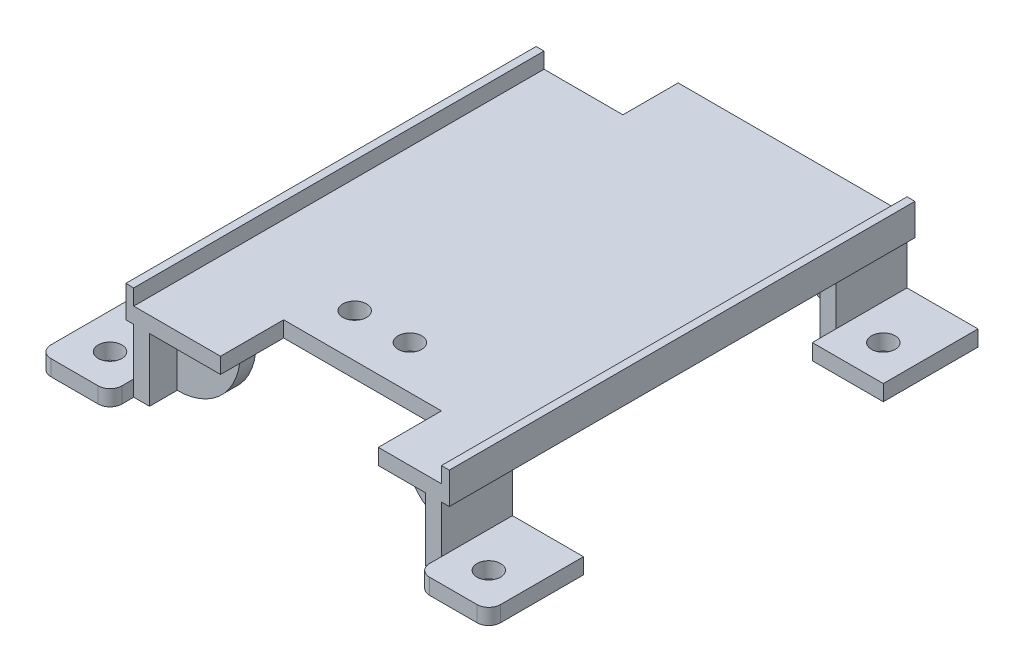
ISO-10303-21;
HEADER;
FILE_DESCRIPTION(('STEP AP214'),'2;1');
FILE_NAME('part.step','',(''),(''),'','','');
FILE_SCHEMA(('AUTOMOTIVE_DESIGN { 1 0 10303 214 1 1 1 1 }'));
ENDSEC;
DATA;
#1=APPLICATION_CONTEXT('core data for automotive mechanical design processes');
#2=APPLICATION_PROTOCOL_DEFINITION('international standard','automotive_design',2000,#1);
#3=PRODUCT_CONTEXT('',#1,'mechanical');
#4=PRODUCT('Part','Part','',(#3));
#5=PRODUCT_RELATED_PRODUCT_CATEGORY('part','',(#4));
#6=PRODUCT_DEFINITION_FORMATION('','',#4);
#7=PRODUCT_DEFINITION_CONTEXT('part definition',#1,'design');
#8=PRODUCT_DEFINITION('design','',#6,#7);
#9=PRODUCT_DEFINITION_SHAPE('','',#8);
#10=(LENGTH_UNIT() NAMED_UNIT(*) SI_UNIT(.MILLI.,.METRE.));
#11=(NAMED_UNIT(*) PLANE_ANGLE_UNIT() SI_UNIT($,.RADIAN.));
#12=(NAMED_UNIT(*) SI_UNIT($,.STERADIAN.) SOLID_ANGLE_UNIT());
#13=UNCERTAINTY_MEASURE_WITH_UNIT(LENGTH_MEASURE(1.E-05),#10,'distance_accuracy_value','');
#14=(GEOMETRIC_REPRESENTATION_CONTEXT(3) GLOBAL_UNCERTAINTY_ASSIGNED_CONTEXT((#13)) GLOBAL_UNIT_ASSIGNED_CONTEXT((#10,
#11,#12)) REPRESENTATION_CONTEXT('',''));
#15=CARTESIAN_POINT('',(0.,0.,0.));
#16=DIRECTION('',(0.,0.,1.));
#17=DIRECTION('',(1.,0.,0.));
#18=AXIS2_PLACEMENT_3D('',#15,#16,#17);
#19=CARTESIAN_POINT('',(48.,10.,-50.));
#20=DIRECTION('',(0.,0.,-1.));
#21=DIRECTION('',(-1.,0.,0.));
#22=AXIS2_PLACEMENT_3D('',#19,#20,#21);
#23=PLANE('',#22);
#24=DIRECTION('',(0.,-1.,0.));
#25=VECTOR('',#24,1.);
#26=CARTESIAN_POINT('',(48.,2.,-50.));
#27=LINE('',#26,#25);
#28=CARTESIAN_POINT('',(48.,2.,-50.));
#29=VERTEX_POINT('',#28);
#30=CARTESIAN_POINT('',(48.,0.,-50.));
#31=VERTEX_POINT('',#30);
#32=EDGE_CURVE('E442',#29,#31,#27,.T.);
#33=ORIENTED_EDGE('',*,*,#32,.F.);
#34=DIRECTION('',(0.,-1.,0.));
#35=VECTOR('',#34,1.);
#36=CARTESIAN_POINT('',(48.,8.,-50.));
#37=LINE('',#36,#35);
#38=CARTESIAN_POINT('',(48.,8.,-50.));
#39=VERTEX_POINT('',#38);
#40=EDGE_CURVE('E772',#39,#29,#37,.T.);
#41=ORIENTED_EDGE('',*,*,#40,.F.);
#42=DIRECTION('',(1.,0.,0.));
#43=VECTOR('',#42,1.);
#44=CARTESIAN_POINT('',(48.,8.,-50.));
#45=LINE('',#44,#43);
#46=CARTESIAN_POINT('',(46.,8.,-50.));
#47=VERTEX_POINT('',#46);
#48=EDGE_CURVE('E767',#47,#39,#45,.T.);
#49=ORIENTED_EDGE('',*,*,#48,.F.);
#50=DIRECTION('',(0.,-1.,0.));
#51=VECTOR('',#50,1.);
#52=CARTESIAN_POINT('',(46.,8.,-50.));
#53=LINE('',#52,#51);
#54=CARTESIAN_POINT('',(46.,0.,-50.));
#55=VERTEX_POINT('',#54);
#56=EDGE_CURVE('E777',#47,#55,#53,.T.);
#57=ORIENTED_EDGE('',*,*,#56,.T.);
#58=DIRECTION('',(1.,0.,0.));
#59=VECTOR('',#58,1.);
#60=CARTESIAN_POINT('',(48.,0.,-50.));
#61=LINE('',#60,#59);
#62=EDGE_CURVE('E965',#55,#31,#61,.T.);
#63=ORIENTED_EDGE('',*,*,#62,.T.);
#64=EDGE_LOOP('',(#33,#41,#49,#57,#63));
#65=FACE_BOUND('',#64,.T.);
#66=ADVANCED_FACE('F40',(#65),#23,.F.);
#67=CARTESIAN_POINT('',(9.,10.,-43.));
#68=DIRECTION('',(0.,0.,-1.));
#69=DIRECTION('',(-1.,0.,0.));
#70=AXIS2_PLACEMENT_3D('',#67,#68,#69);
#71=PLANE('',#70);
#72=DIRECTION('',(0.,1.,0.));
#73=VECTOR('',#72,1.);
#74=CARTESIAN_POINT('',(9.,2.,-43.));
#75=LINE('',#74,#73);
#76=CARTESIAN_POINT('',(9.,0.,-43.));
#77=VERTEX_POINT('',#76);
#78=CARTESIAN_POINT('',(9.,2.,-43.));
#79=VERTEX_POINT('',#78);
#80=EDGE_CURVE('E448',#77,#79,#75,.T.);
#81=ORIENTED_EDGE('',*,*,#80,.F.);
#82=DIRECTION('',(-1.,0.,0.));
#83=VECTOR('',#82,1.);
#84=CARTESIAN_POINT('',(9.,0.,-43.));
#85=LINE('',#84,#83);
#86=CARTESIAN_POINT('',(11.,0.,-43.));
#87=VERTEX_POINT('',#86);
#88=EDGE_CURVE('E942',#87,#77,#85,.T.);
#89=ORIENTED_EDGE('',*,*,#88,.F.);
#90=DIRECTION('',(0.,-1.,0.));
#91=VECTOR('',#90,1.);
#92=CARTESIAN_POINT('',(11.,8.,-43.));
#93=LINE('',#92,#91);
#94=CARTESIAN_POINT('',(11.,8.,-43.));
#95=VERTEX_POINT('',#94);
#96=EDGE_CURVE('E758',#95,#87,#93,.T.);
#97=ORIENTED_EDGE('',*,*,#96,.F.);
#98=DIRECTION('',(1.,0.,0.));
#99=VECTOR('',#98,1.);
#100=CARTESIAN_POINT('',(9.,8.,-43.));
#101=LINE('',#100,#99);
#102=CARTESIAN_POINT('',(9.,8.,-43.));
#103=VERTEX_POINT('',#102);
#104=EDGE_CURVE('E742',#103,#95,#101,.T.);
#105=ORIENTED_EDGE('',*,*,#104,.F.);
#106=DIRECTION('',(0.,-1.,0.));
#107=VECTOR('',#106,1.);
#108=CARTESIAN_POINT('',(9.,8.,-43.));
#109=LINE('',#108,#107);
#110=EDGE_CURVE('E749',#103,#79,#109,.T.);
#111=ORIENTED_EDGE('',*,*,#110,.T.);
#112=EDGE_LOOP('',(#81,#89,#97,#105,#111));
#113=FACE_BOUND('',#112,.T.);
#114=ADVANCED_FACE('F1102',(#113),#71,.F.);
#115=CARTESIAN_POINT('',(0.,10.,0.));
#116=DIRECTION('',(0.,0.,-1.));
#117=DIRECTION('',(-1.,0.,0.));
#118=AXIS2_PLACEMENT_3D('',#115,#116,#117);
#119=PLANE('',#118);
#120=DIRECTION('',(0.,-1.,0.));
#121=VECTOR('',#120,1.);
#122=CARTESIAN_POINT('',(48.,2.,0.));
#123=LINE('',#122,#121);
#124=CARTESIAN_POINT('',(48.,2.,0.));
#125=VERTEX_POINT('',#124);
#126=CARTESIAN_POINT('',(48.,0.,0.));
#127=VERTEX_POINT('',#126);
#128=EDGE_CURVE('E479',#125,#127,#123,.T.);
#129=ORIENTED_EDGE('',*,*,#128,.F.);
#130=DIRECTION('',(0.,1.,0.));
#131=VECTOR('',#130,1.);
#132=CARTESIAN_POINT('',(48.,2.,0.));
#133=LINE('',#132,#131);
#134=CARTESIAN_POINT('',(48.,8.,0.));
#135=VERTEX_POINT('',#134);
#136=EDGE_CURVE('E839',#125,#135,#133,.T.);
#137=ORIENTED_EDGE('',*,*,#136,.T.);
#138=DIRECTION('',(-1.,0.,0.));
#139=VECTOR('',#138,1.);
#140=CARTESIAN_POINT('',(49.,8.,0.));
#141=LINE('',#140,#139);
#142=CARTESIAN_POINT('',(49.,8.,0.));
#143=VERTEX_POINT('',#142);
#144=EDGE_CURVE('E605',#143,#135,#141,.T.);
#145=ORIENTED_EDGE('',*,*,#144,.F.);
#146=DIRECTION('',(0.,-1.,0.));
#147=VECTOR('',#146,1.);
#148=CARTESIAN_POINT('',(49.,10.,0.));
#149=LINE('',#148,#147);
#150=CARTESIAN_POINT('',(49.,12.,0.));
#151=VERTEX_POINT('',#150);
#152=EDGE_CURVE('E588',#151,#143,#149,.T.);
#153=ORIENTED_EDGE('',*,*,#152,.F.);
#154=DIRECTION('',(1.,0.,0.));
#155=VECTOR('',#154,1.);
#156=CARTESIAN_POINT('',(49.,12.,0.));
#157=LINE('',#156,#155);
#158=CARTESIAN_POINT('',(48.,12.,0.));
#159=VERTEX_POINT('',#158);
#160=EDGE_CURVE('E572',#159,#151,#157,.T.);
#161=ORIENTED_EDGE('',*,*,#160,.F.);
#162=DIRECTION('',(0.,-1.,0.));
#163=VECTOR('',#162,1.);
#164=CARTESIAN_POINT('',(48.,12.,0.));
#165=LINE('',#164,#163);
#166=CARTESIAN_POINT('',(48.,10.,0.));
#167=VERTEX_POINT('',#166);
#168=EDGE_CURVE('E576',#159,#167,#165,.T.);
#169=ORIENTED_EDGE('',*,*,#168,.T.);
#170=DIRECTION('',(1.,0.,0.));
#171=VECTOR('',#170,1.);
#172=CARTESIAN_POINT('',(0.,10.,0.));
#173=LINE('',#172,#171);
#174=CARTESIAN_POINT('',(40.,10.,0.));
#175=VERTEX_POINT('',#174);
#176=EDGE_CURVE('E976',#175,#167,#173,.T.);
#177=ORIENTED_EDGE('',*,*,#176,.F.);
#178=DIRECTION('',(0.,1.,0.));
#179=VECTOR('',#178,1.);
#180=CARTESIAN_POINT('',(40.,10.,0.));
#181=LINE('',#180,#179);
#182=CARTESIAN_POINT('',(40.,8.,0.));
#183=VERTEX_POINT('',#182);
#184=EDGE_CURVE('E918',#183,#175,#181,.T.);
#185=ORIENTED_EDGE('',*,*,#184,.F.);
#186=DIRECTION('',(-1.,0.,0.));
#187=VECTOR('',#186,1.);
#188=CARTESIAN_POINT('',(11.,8.,0.));
#189=LINE('',#188,#187);
#190=CARTESIAN_POINT('',(46.,8.,0.));
#191=VERTEX_POINT('',#190);
#192=EDGE_CURVE('E878',#191,#183,#189,.T.);
#193=ORIENTED_EDGE('',*,*,#192,.F.);
#194=DIRECTION('',(0.,-1.,0.));
#195=VECTOR('',#194,1.);
#196=CARTESIAN_POINT('',(46.,8.,0.));
#197=LINE('',#196,#195);
#198=CARTESIAN_POINT('',(46.,0.,0.));
#199=VERTEX_POINT('',#198);
#200=EDGE_CURVE('E899',#191,#199,#197,.T.);
#201=ORIENTED_EDGE('',*,*,#200,.T.);
#202=DIRECTION('',(1.,0.,0.));
#203=VECTOR('',#202,1.);
#204=CARTESIAN_POINT('',(0.,0.,0.));
#205=LINE('',#204,#203);
#206=EDGE_CURVE('E983',#199,#127,#205,.T.);
#207=ORIENTED_EDGE('',*,*,#206,.T.);
#208=EDGE_LOOP('',(#129,#137,#145,#153,#161,#169,#177,#185,#193,#201,#207));
#209=FACE_BOUND('',#208,.T.);
#210=ADVANCED_FACE('F1108',(#209),#119,.F.);
#211=DIRECTION('',(0.,1.,0.));
#212=VECTOR('',#211,1.);
#213=CARTESIAN_POINT('',(9.,2.,0.));
#214=LINE('',#213,#212);
#215=CARTESIAN_POINT('',(9.,0.,0.));
#216=VERTEX_POINT('',#215);
#217=CARTESIAN_POINT('',(9.,2.,0.));
#218=VERTEX_POINT('',#217);
#219=EDGE_CURVE('E497',#216,#218,#214,.T.);
#220=ORIENTED_EDGE('',*,*,#219,.F.);
#221=CARTESIAN_POINT('',(11.,0.,0.));
#222=VERTEX_POINT('',#221);
#223=EDGE_CURVE('E984',#216,#222,#205,.T.);
#224=ORIENTED_EDGE('',*,*,#223,.T.);
#225=DIRECTION('',(0.,-1.,0.));
#226=VECTOR('',#225,1.);
#227=CARTESIAN_POINT('',(11.,8.,0.));
#228=LINE('',#227,#226);
#229=CARTESIAN_POINT('',(11.,8.,0.));
#230=VERTEX_POINT('',#229);
#231=EDGE_CURVE('E894',#230,#222,#228,.T.);
#232=ORIENTED_EDGE('',*,*,#231,.F.);
#233=CARTESIAN_POINT('',(20.,8.,0.));
#234=VERTEX_POINT('',#233);
#235=EDGE_CURVE('E875',#234,#230,#189,.T.);
#236=ORIENTED_EDGE('',*,*,#235,.F.);
#237=DIRECTION('',(0.,-1.,0.));
#238=VECTOR('',#237,1.);
#239=CARTESIAN_POINT('',(20.,10.,0.));
#240=LINE('',#239,#238);
#241=CARTESIAN_POINT('',(20.,10.,0.));
#242=VERTEX_POINT('',#241);
#243=EDGE_CURVE('E912',#242,#234,#240,.T.);
#244=ORIENTED_EDGE('',*,*,#243,.F.);
#245=CARTESIAN_POINT('',(9.00000000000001,10.,0.));
#246=VERTEX_POINT('',#245);
#247=EDGE_CURVE('E972',#246,#242,#173,.T.);
#248=ORIENTED_EDGE('',*,*,#247,.F.);
#249=DIRECTION('',(0.,-1.,0.));
#250=VECTOR('',#249,1.);
#251=CARTESIAN_POINT('',(9.00000000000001,12.,0.));
#252=LINE('',#251,#250);
#253=CARTESIAN_POINT('',(9.00000000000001,12.,0.));
#254=VERTEX_POINT('',#253);
#255=EDGE_CURVE('E536',#254,#246,#252,.T.);
#256=ORIENTED_EDGE('',*,*,#255,.F.);
#257=DIRECTION('',(1.,0.,0.));
#258=VECTOR('',#257,1.);
#259=CARTESIAN_POINT('',(8.,12.,0.));
#260=LINE('',#259,#258);
#261=CARTESIAN_POINT('',(8.,12.,0.));
#262=VERTEX_POINT('',#261);
#263=EDGE_CURVE('E520',#262,#254,#260,.T.);
#264=ORIENTED_EDGE('',*,*,#263,.F.);
#265=DIRECTION('',(0.,1.,0.));
#266=VECTOR('',#265,1.);
#267=CARTESIAN_POINT('',(8.,10.,0.));
#268=LINE('',#267,#266);
#269=CARTESIAN_POINT('',(8.,8.,0.));
#270=VERTEX_POINT('',#269);
#271=EDGE_CURVE('E547',#270,#262,#268,.T.);
#272=ORIENTED_EDGE('',*,*,#271,.F.);
#273=DIRECTION('',(1.,0.,0.));
#274=VECTOR('',#273,1.);
#275=CARTESIAN_POINT('',(8.,8.,0.));
#276=LINE('',#275,#274);
#277=CARTESIAN_POINT('',(9.,8.,0.));
#278=VERTEX_POINT('',#277);
#279=EDGE_CURVE('E550',#270,#278,#276,.T.);
#280=ORIENTED_EDGE('',*,*,#279,.T.);
#281=DIRECTION('',(0.,1.,0.));
#282=VECTOR('',#281,1.);
#283=CARTESIAN_POINT('',(9.,2.,0.));
#284=LINE('',#283,#282);
#285=EDGE_CURVE('E797',#218,#278,#284,.T.);
#286=ORIENTED_EDGE('',*,*,#285,.F.);
#287=EDGE_LOOP('',(#220,#224,#232,#236,#244,#248,#256,#264,#272,#280,#286));
#288=FACE_BOUND('',#287,.T.);
#289=ADVANCED_FACE('F1079',(#288),#119,.F.);
#290=CARTESIAN_POINT('',(0.,10.,0.));
#291=DIRECTION('',(0.,-1.,0.));
#292=DIRECTION('',(0.,0.,-1.));
#293=AXIS2_PLACEMENT_3D('',#290,#291,#292);
#294=PLANE('',#293);
#295=CARTESIAN_POINT('',(23.5,10.,-13.5));
#296=DIRECTION('',(0.,1.,0.));
#297=DIRECTION('',(0.,0.,1.));
#298=AXIS2_PLACEMENT_3D('',#295,#296,#297);
#299=CIRCLE('',#298,1.5);
#300=CARTESIAN_POINT('',(23.5,10.,-12.));
#301=VERTEX_POINT('',#300);
#302=EDGE_CURVE('E610',#301,#301,#299,.T.);
#303=ORIENTED_EDGE('',*,*,#302,.F.);
#304=EDGE_LOOP('',(#303));
#305=FACE_BOUND('',#304,.T.);
#306=CARTESIAN_POINT('',(30.5,10.,-13.5));
#307=DIRECTION('',(0.,1.,0.));
#308=DIRECTION('',(0.,0.,1.));
#309=AXIS2_PLACEMENT_3D('',#306,#307,#308);
#310=CIRCLE('',#309,1.5);
#311=CARTESIAN_POINT('',(30.5,10.,-12.));
#312=VERTEX_POINT('',#311);
#313=EDGE_CURVE('E609',#312,#312,#310,.T.);
#314=ORIENTED_EDGE('',*,*,#313,.F.);
#315=EDGE_LOOP('',(#314));
#316=FACE_BOUND('',#315,.T.);
#317=DIRECTION('',(0.,0.,-1.));
#318=VECTOR('',#317,1.);
#319=CARTESIAN_POINT('',(9.,10.,-52.));
#320=LINE('',#319,#318);
#321=CARTESIAN_POINT('',(9.,10.,-52.));
#322=VERTEX_POINT('',#321);
#323=EDGE_CURVE('E515',#246,#322,#320,.T.);
#324=ORIENTED_EDGE('',*,*,#323,.F.);
#325=ORIENTED_EDGE('',*,*,#247,.T.);
#326=DIRECTION('',(0.,0.,1.));
#327=VECTOR('',#326,1.);
#328=CARTESIAN_POINT('',(20.,10.,-8.));
#329=LINE('',#328,#327);
#330=CARTESIAN_POINT('',(20.,10.,-8.));
#331=VERTEX_POINT('',#330);
#332=EDGE_CURVE('E931',#331,#242,#329,.T.);
#333=ORIENTED_EDGE('',*,*,#332,.F.);
#334=DIRECTION('',(-1.,0.,0.));
#335=VECTOR('',#334,1.);
#336=CARTESIAN_POINT('',(20.,10.,-8.));
#337=LINE('',#336,#335);
#338=CARTESIAN_POINT('',(40.,10.,-8.));
#339=VERTEX_POINT('',#338);
#340=EDGE_CURVE('E921',#339,#331,#337,.T.);
#341=ORIENTED_EDGE('',*,*,#340,.F.);
#342=DIRECTION('',(0.,0.,1.));
#343=VECTOR('',#342,1.);
#344=CARTESIAN_POINT('',(40.,10.,-8.));
#345=LINE('',#344,#343);
#346=EDGE_CURVE('E925',#339,#175,#345,.T.);
#347=ORIENTED_EDGE('',*,*,#346,.T.);
#348=ORIENTED_EDGE('',*,*,#176,.T.);
#349=DIRECTION('',(0.,0.,1.));
#350=VECTOR('',#349,1.);
#351=CARTESIAN_POINT('',(48.,10.,-59.));
#352=LINE('',#351,#350);
#353=CARTESIAN_POINT('',(48.,10.,-59.));
#354=VERTEX_POINT('',#353);
#355=EDGE_CURVE('E561',#354,#167,#352,.T.);
#356=ORIENTED_EDGE('',*,*,#355,.F.);
#357=DIRECTION('',(-1.,0.,0.));
#358=VECTOR('',#357,1.);
#359=CARTESIAN_POINT('',(0.,10.,-59.));
#360=LINE('',#359,#358);
#361=CARTESIAN_POINT('',(19.,10.,-59.));
#362=VERTEX_POINT('',#361);
#363=EDGE_CURVE('E975',#354,#362,#360,.T.);
#364=ORIENTED_EDGE('',*,*,#363,.T.);
#365=DIRECTION('',(0.,0.,-1.));
#366=VECTOR('',#365,1.);
#367=CARTESIAN_POINT('',(19.,10.,-52.));
#368=LINE('',#367,#366);
#369=CARTESIAN_POINT('',(19.,10.,-52.));
#370=VERTEX_POINT('',#369);
#371=EDGE_CURVE('E843',#370,#362,#368,.T.);
#372=ORIENTED_EDGE('',*,*,#371,.F.);
#373=DIRECTION('',(1.,0.,0.));
#374=VECTOR('',#373,1.);
#375=CARTESIAN_POINT('',(0.,10.,-52.));
#376=LINE('',#375,#374);
#377=EDGE_CURVE('E946',#322,#370,#376,.T.);
#378=ORIENTED_EDGE('',*,*,#377,.F.);
#379=EDGE_LOOP('',(#324,#325,#333,#341,#347,#348,#356,#364,#372,#378));
#380=FACE_BOUND('',#379,.T.);
#381=ADVANCED_FACE('F1121',(#305,#316,#380),#294,.F.);
#382=CARTESIAN_POINT('',(9.,0.,0.));
#383=DIRECTION('',(-1.,0.,0.));
#384=DIRECTION('',(0.,0.,1.));
#385=AXIS2_PLACEMENT_3D('',#382,#383,#384);
#386=PLANE('',#385);
#387=ORIENTED_EDGE('',*,*,#285,.T.);
#388=DIRECTION('',(0.,0.,-1.));
#389=VECTOR('',#388,1.);
#390=CARTESIAN_POINT('',(9.,8.,0.));
#391=LINE('',#390,#389);
#392=CARTESIAN_POINT('',(9.,8.,-9.));
#393=VERTEX_POINT('',#392);
#394=EDGE_CURVE('E1010',#278,#393,#391,.T.);
#395=ORIENTED_EDGE('',*,*,#394,.T.);
#396=DIRECTION('',(0.,-1.,0.));
#397=VECTOR('',#396,1.);
#398=CARTESIAN_POINT('',(9.,8.,-9.));
#399=LINE('',#398,#397);
#400=CARTESIAN_POINT('',(9.,2.,-9.));
#401=VERTEX_POINT('',#400);
#402=EDGE_CURVE('E750',#393,#401,#399,.T.);
#403=ORIENTED_EDGE('',*,*,#402,.T.);
#404=DIRECTION('',(0.,0.,-1.));
#405=VECTOR('',#404,1.);
#406=CARTESIAN_POINT('',(9.,2.,0.));
#407=LINE('',#406,#405);
#408=EDGE_CURVE('E776',#218,#401,#407,.T.);
#409=ORIENTED_EDGE('',*,*,#408,.F.);
#410=EDGE_LOOP('',(#387,#395,#403,#409));
#411=FACE_BOUND('',#410,.T.);
#412=ADVANCED_FACE('F1075',(#411),#386,.T.);
#413=ORIENTED_EDGE('',*,*,#110,.F.);
#414=DIRECTION('',(0.,0.,1.));
#415=VECTOR('',#414,1.);
#416=CARTESIAN_POINT('',(9.,8.,-52.));
#417=LINE('',#416,#415);
#418=CARTESIAN_POINT('',(9.,8.,-52.));
#419=VERTEX_POINT('',#418);
#420=EDGE_CURVE('E539',#419,#103,#417,.T.);
#421=ORIENTED_EDGE('',*,*,#420,.F.);
#422=DIRECTION('',(0.,1.,0.));
#423=VECTOR('',#422,1.);
#424=CARTESIAN_POINT('',(9.,2.,-52.));
#425=LINE('',#424,#423);
#426=CARTESIAN_POINT('',(9.,2.,-52.));
#427=VERTEX_POINT('',#426);
#428=EDGE_CURVE('E810',#427,#419,#425,.T.);
#429=ORIENTED_EDGE('',*,*,#428,.F.);
#430=DIRECTION('',(0.,0.,-1.));
#431=VECTOR('',#430,1.);
#432=CARTESIAN_POINT('',(9.,2.,-52.));
#433=LINE('',#432,#431);
#434=EDGE_CURVE('E803',#79,#427,#433,.T.);
#435=ORIENTED_EDGE('',*,*,#434,.F.);
#436=EDGE_LOOP('',(#413,#421,#429,#435));
#437=FACE_BOUND('',#436,.T.);
#438=ADVANCED_FACE('F1285',(#437),#386,.T.);
#439=CARTESIAN_POINT('',(48.,0.,0.));
#440=DIRECTION('',(1.,0.,0.));
#441=DIRECTION('',(0.,0.,-1.));
#442=AXIS2_PLACEMENT_3D('',#439,#440,#441);
#443=PLANE('',#442);
#444=DIRECTION('',(0.,1.,0.));
#445=VECTOR('',#444,1.);
#446=CARTESIAN_POINT('',(48.,2.,-59.));
#447=LINE('',#446,#445);
#448=CARTESIAN_POINT('',(48.,2.,-59.));
#449=VERTEX_POINT('',#448);
#450=CARTESIAN_POINT('',(48.,8.,-59.));
#451=VERTEX_POINT('',#450);
#452=EDGE_CURVE('E825',#449,#451,#447,.T.);
#453=ORIENTED_EDGE('',*,*,#452,.T.);
#454=DIRECTION('',(0.,0.,1.));
#455=VECTOR('',#454,1.);
#456=CARTESIAN_POINT('',(48.,8.,0.));
#457=LINE('',#456,#455);
#458=EDGE_CURVE('E1007',#451,#39,#457,.T.);
#459=ORIENTED_EDGE('',*,*,#458,.T.);
#460=ORIENTED_EDGE('',*,*,#40,.T.);
#461=DIRECTION('',(0.,0.,1.));
#462=VECTOR('',#461,1.);
#463=CARTESIAN_POINT('',(48.,2.,-59.));
#464=LINE('',#463,#462);
#465=EDGE_CURVE('E814',#449,#29,#464,.T.);
#466=ORIENTED_EDGE('',*,*,#465,.F.);
#467=EDGE_LOOP('',(#453,#459,#460,#466));
#468=FACE_BOUND('',#467,.T.);
#469=ADVANCED_FACE('F1113',(#468),#443,.T.);
#470=DIRECTION('',(0.,-1.,0.));
#471=VECTOR('',#470,1.);
#472=CARTESIAN_POINT('',(48.,8.,-9.));
#473=LINE('',#472,#471);
#474=CARTESIAN_POINT('',(48.,8.,-9.));
#475=VERTEX_POINT('',#474);
#476=CARTESIAN_POINT('',(48.,2.,-9.));
#477=VERTEX_POINT('',#476);
#478=EDGE_CURVE('E771',#475,#477,#473,.T.);
#479=ORIENTED_EDGE('',*,*,#478,.F.);
#480=DIRECTION('',(0.,0.,-1.));
#481=VECTOR('',#480,1.);
#482=CARTESIAN_POINT('',(48.,8.,0.));
#483=LINE('',#482,#481);
#484=EDGE_CURVE('E587',#135,#475,#483,.T.);
#485=ORIENTED_EDGE('',*,*,#484,.F.);
#486=ORIENTED_EDGE('',*,*,#136,.F.);
#487=DIRECTION('',(0.,0.,1.));
#488=VECTOR('',#487,1.);
#489=CARTESIAN_POINT('',(48.,2.,0.));
#490=LINE('',#489,#488);
#491=EDGE_CURVE('E828',#477,#125,#490,.T.);
#492=ORIENTED_EDGE('',*,*,#491,.F.);
#493=EDGE_LOOP('',(#479,#485,#486,#492));
#494=FACE_BOUND('',#493,.T.);
#495=ADVANCED_FACE('F1230',(#494),#443,.T.);
#496=CARTESIAN_POINT('',(0.,8.,0.));
#497=DIRECTION('',(0.,-1.,0.));
#498=DIRECTION('',(0.,0.,-1.));
#499=AXIS2_PLACEMENT_3D('',#496,#497,#498);
#500=PLANE('',#499);
#501=CARTESIAN_POINT('',(23.5,8.,-13.5));
#502=DIRECTION('',(0.,-1.,0.));
#503=DIRECTION('',(0.,0.,-1.));
#504=AXIS2_PLACEMENT_3D('',#501,#502,#503);
#505=CIRCLE('',#504,1.5);
#506=CARTESIAN_POINT('',(23.5,8.,-15.));
#507=VERTEX_POINT('',#506);
#508=EDGE_CURVE('E621',#507,#507,#505,.T.);
#509=ORIENTED_EDGE('',*,*,#508,.F.);
#510=EDGE_LOOP('',(#509));
#511=FACE_BOUND('',#510,.T.);
#512=CARTESIAN_POINT('',(30.5,8.,-13.5));
#513=DIRECTION('',(0.,-1.,0.));
#514=DIRECTION('',(0.,0.,-1.));
#515=AXIS2_PLACEMENT_3D('',#512,#513,#514);
#516=CIRCLE('',#515,1.5);
#517=CARTESIAN_POINT('',(30.5,8.,-15.));
#518=VERTEX_POINT('',#517);
#519=EDGE_CURVE('E614',#518,#518,#516,.T.);
#520=ORIENTED_EDGE('',*,*,#519,.F.);
#521=EDGE_LOOP('',(#520));
#522=FACE_BOUND('',#521,.T.);
#523=DIRECTION('',(0.,0.,1.));
#524=VECTOR('',#523,1.);
#525=CARTESIAN_POINT('',(38.,8.00000000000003,-53.5));
#526=LINE('',#525,#524);
#527=CARTESIAN_POINT('',(38.,8.,-55.5));
#528=VERTEX_POINT('',#527);
#529=CARTESIAN_POINT('',(38.,8.,-53.5));
#530=VERTEX_POINT('',#529);
#531=EDGE_CURVE('E643',#528,#530,#526,.T.);
#532=ORIENTED_EDGE('',*,*,#531,.T.);
#533=DIRECTION('',(1.,0.,0.));
#534=VECTOR('',#533,1.);
#535=CARTESIAN_POINT('',(38.,8.00000000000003,-53.5));
#536=LINE('',#535,#534);
#537=CARTESIAN_POINT('',(46.,8.,-53.5));
#538=VERTEX_POINT('',#537);
#539=EDGE_CURVE('E637',#530,#538,#536,.T.);
#540=ORIENTED_EDGE('',*,*,#539,.T.);
#541=DIRECTION('',(0.,0.,1.));
#542=VECTOR('',#541,1.);
#543=CARTESIAN_POINT('',(46.,8.,0.));
#544=LINE('',#543,#542);
#545=EDGE_CURVE('E876',#538,#47,#544,.T.);
#546=ORIENTED_EDGE('',*,*,#545,.T.);
#547=ORIENTED_EDGE('',*,*,#48,.T.);
#548=ORIENTED_EDGE('',*,*,#458,.F.);
#549=DIRECTION('',(-1.,0.,0.));
#550=VECTOR('',#549,1.);
#551=CARTESIAN_POINT('',(49.,8.,-59.));
#552=LINE('',#551,#550);
#553=CARTESIAN_POINT('',(49.,8.,-59.));
#554=VERTEX_POINT('',#553);
#555=EDGE_CURVE('E598',#554,#451,#552,.T.);
#556=ORIENTED_EDGE('',*,*,#555,.F.);
#557=DIRECTION('',(0.,0.,-1.));
#558=VECTOR('',#557,1.);
#559=CARTESIAN_POINT('',(49.,8.,0.));
#560=LINE('',#559,#558);
#561=EDGE_CURVE('E592',#143,#554,#560,.T.);
#562=ORIENTED_EDGE('',*,*,#561,.F.);
#563=ORIENTED_EDGE('',*,*,#144,.T.);
#564=ORIENTED_EDGE('',*,*,#484,.T.);
#565=DIRECTION('',(-1.,0.,0.));
#566=VECTOR('',#565,1.);
#567=CARTESIAN_POINT('',(48.,8.,-9.));
#568=LINE('',#567,#566);
#569=CARTESIAN_POINT('',(46.,8.,-9.));
#570=VERTEX_POINT('',#569);
#571=EDGE_CURVE('E753',#475,#570,#568,.T.);
#572=ORIENTED_EDGE('',*,*,#571,.T.);
#573=CARTESIAN_POINT('',(46.,8.,-5.5));
#574=VERTEX_POINT('',#573);
#575=EDGE_CURVE('E877',#570,#574,#544,.T.);
#576=ORIENTED_EDGE('',*,*,#575,.T.);
#577=DIRECTION('',(1.,0.,0.));
#578=VECTOR('',#577,1.);
#579=CARTESIAN_POINT('',(40.,8.,-5.5));
#580=LINE('',#579,#578);
#581=CARTESIAN_POINT('',(40.,8.,-5.5));
#582=VERTEX_POINT('',#581);
#583=EDGE_CURVE('E658',#582,#574,#580,.T.);
#584=ORIENTED_EDGE('',*,*,#583,.F.);
#585=DIRECTION('',(0.,0.,-1.));
#586=VECTOR('',#585,1.);
#587=CARTESIAN_POINT('',(40.,8.,-8.));
#588=LINE('',#587,#586);
#589=CARTESIAN_POINT('',(40.,8.,-8.));
#590=VERTEX_POINT('',#589);
#591=EDGE_CURVE('E898',#582,#590,#588,.T.);
#592=ORIENTED_EDGE('',*,*,#591,.T.);
#593=DIRECTION('',(1.,0.,0.));
#594=VECTOR('',#593,1.);
#595=CARTESIAN_POINT('',(0.,8.,-8.));
#596=LINE('',#595,#594);
#597=CARTESIAN_POINT('',(20.,8.,-8.));
#598=VERTEX_POINT('',#597);
#599=EDGE_CURVE('E996',#598,#590,#596,.T.);
#600=ORIENTED_EDGE('',*,*,#599,.F.);
#601=DIRECTION('',(0.,0.,1.));
#602=VECTOR('',#601,1.);
#603=CARTESIAN_POINT('',(20.,8.,-8.));
#604=LINE('',#603,#602);
#605=EDGE_CURVE('E909',#598,#234,#604,.T.);
#606=ORIENTED_EDGE('',*,*,#605,.T.);
#607=ORIENTED_EDGE('',*,*,#235,.T.);
#608=DIRECTION('',(0.,0.,-1.));
#609=VECTOR('',#608,1.);
#610=CARTESIAN_POINT('',(11.,8.,0.));
#611=LINE('',#610,#609);
#612=CARTESIAN_POINT('',(11.,8.,-3.5));
#613=VERTEX_POINT('',#612);
#614=EDGE_CURVE('E860',#230,#613,#611,.T.);
#615=ORIENTED_EDGE('',*,*,#614,.T.);
#616=DIRECTION('',(1.,0.,0.));
#617=VECTOR('',#616,1.);
#618=CARTESIAN_POINT('',(11.,8.,-3.5));
#619=LINE('',#618,#617);
#620=CARTESIAN_POINT('',(19.,8.00000000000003,-3.5));
#621=VERTEX_POINT('',#620);
#622=EDGE_CURVE('E724',#613,#621,#619,.T.);
#623=ORIENTED_EDGE('',*,*,#622,.T.);
#624=DIRECTION('',(0.,0.,-1.));
#625=VECTOR('',#624,1.);
#626=CARTESIAN_POINT('',(19.,8.00000000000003,-3.5));
#627=LINE('',#626,#625);
#628=CARTESIAN_POINT('',(19.,8.00000000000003,-5.5));
#629=VERTEX_POINT('',#628);
#630=EDGE_CURVE('E728',#621,#629,#627,.T.);
#631=ORIENTED_EDGE('',*,*,#630,.T.);
#632=DIRECTION('',(-1.,0.,0.));
#633=VECTOR('',#632,1.);
#634=CARTESIAN_POINT('',(11.,8.,-5.5));
#635=LINE('',#634,#633);
#636=CARTESIAN_POINT('',(11.,8.,-5.5));
#637=VERTEX_POINT('',#636);
#638=EDGE_CURVE('E732',#629,#637,#635,.T.);
#639=ORIENTED_EDGE('',*,*,#638,.T.);
#640=CARTESIAN_POINT('',(11.,8.,-9.));
#641=VERTEX_POINT('',#640);
#642=EDGE_CURVE('E865',#637,#641,#611,.T.);
#643=ORIENTED_EDGE('',*,*,#642,.T.);
#644=DIRECTION('',(-1.,0.,0.));
#645=VECTOR('',#644,1.);
#646=CARTESIAN_POINT('',(9.,8.,-9.));
#647=LINE('',#646,#645);
#648=EDGE_CURVE('E745',#641,#393,#647,.T.);
#649=ORIENTED_EDGE('',*,*,#648,.T.);
#650=ORIENTED_EDGE('',*,*,#394,.F.);
#651=ORIENTED_EDGE('',*,*,#279,.F.);
#652=DIRECTION('',(0.,0.,1.));
#653=VECTOR('',#652,1.);
#654=CARTESIAN_POINT('',(8.,8.,-52.));
#655=LINE('',#654,#653);
#656=CARTESIAN_POINT('',(8.,8.,-52.));
#657=VERTEX_POINT('',#656);
#658=EDGE_CURVE('E544',#657,#270,#655,.T.);
#659=ORIENTED_EDGE('',*,*,#658,.F.);
#660=DIRECTION('',(1.,0.,0.));
#661=VECTOR('',#660,1.);
#662=CARTESIAN_POINT('',(8.,8.,-52.));
#663=LINE('',#662,#661);
#664=EDGE_CURVE('E557',#657,#419,#663,.T.);
#665=ORIENTED_EDGE('',*,*,#664,.T.);
#666=ORIENTED_EDGE('',*,*,#420,.T.);
#667=ORIENTED_EDGE('',*,*,#104,.T.);
#668=CARTESIAN_POINT('',(11.,8.,-46.5));
#669=VERTEX_POINT('',#668);
#670=EDGE_CURVE('E867',#95,#669,#611,.T.);
#671=ORIENTED_EDGE('',*,*,#670,.T.);
#672=DIRECTION('',(1.,0.,0.));
#673=VECTOR('',#672,1.);
#674=CARTESIAN_POINT('',(11.,8.,-46.5));
#675=LINE('',#674,#673);
#676=CARTESIAN_POINT('',(19.,8.,-46.5));
#677=VERTEX_POINT('',#676);
#678=EDGE_CURVE('E695',#669,#677,#675,.T.);
#679=ORIENTED_EDGE('',*,*,#678,.T.);
#680=DIRECTION('',(0.,0.,-1.));
#681=VECTOR('',#680,1.);
#682=CARTESIAN_POINT('',(19.,8.00000000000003,-46.5));
#683=LINE('',#682,#681);
#684=CARTESIAN_POINT('',(19.,8.,-48.5));
#685=VERTEX_POINT('',#684);
#686=EDGE_CURVE('E698',#677,#685,#683,.T.);
#687=ORIENTED_EDGE('',*,*,#686,.T.);
#688=DIRECTION('',(-1.,0.,0.));
#689=VECTOR('',#688,1.);
#690=CARTESIAN_POINT('',(11.,8.,-48.5));
#691=LINE('',#690,#689);
#692=CARTESIAN_POINT('',(11.,8.,-48.5));
#693=VERTEX_POINT('',#692);
#694=EDGE_CURVE('E701',#685,#693,#691,.T.);
#695=ORIENTED_EDGE('',*,*,#694,.T.);
#696=CARTESIAN_POINT('',(11.,8.,-52.));
#697=VERTEX_POINT('',#696);
#698=EDGE_CURVE('E866',#693,#697,#611,.T.);
#699=ORIENTED_EDGE('',*,*,#698,.T.);
#700=DIRECTION('',(-1.,0.,0.));
#701=VECTOR('',#700,1.);
#702=CARTESIAN_POINT('',(0.,8.,-52.));
#703=LINE('',#702,#701);
#704=CARTESIAN_POINT('',(19.,8.,-52.));
#705=VERTEX_POINT('',#704);
#706=EDGE_CURVE('E852',#705,#697,#703,.T.);
#707=ORIENTED_EDGE('',*,*,#706,.F.);
#708=DIRECTION('',(0.,0.,1.));
#709=VECTOR('',#708,1.);
#710=CARTESIAN_POINT('',(19.,8.,0.));
#711=LINE('',#710,#709);
#712=CARTESIAN_POINT('',(19.,8.,-59.));
#713=VERTEX_POINT('',#712);
#714=EDGE_CURVE('E1004',#713,#705,#711,.T.);
#715=ORIENTED_EDGE('',*,*,#714,.F.);
#716=DIRECTION('',(1.,0.,0.));
#717=VECTOR('',#716,1.);
#718=CARTESIAN_POINT('',(11.,8.,-59.));
#719=LINE('',#718,#717);
#720=CARTESIAN_POINT('',(46.,8.,-59.));
#721=VERTEX_POINT('',#720);
#722=EDGE_CURVE('E864',#713,#721,#719,.T.);
#723=ORIENTED_EDGE('',*,*,#722,.T.);
#724=CARTESIAN_POINT('',(46.,8.,-55.5));
#725=VERTEX_POINT('',#724);
#726=EDGE_CURVE('E871',#721,#725,#544,.T.);
#727=ORIENTED_EDGE('',*,*,#726,.T.);
#728=DIRECTION('',(-1.,0.,0.));
#729=VECTOR('',#728,1.);
#730=CARTESIAN_POINT('',(38.,8.00000000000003,-55.5));
#731=LINE('',#730,#729);
#732=EDGE_CURVE('E640',#725,#528,#731,.T.);
#733=ORIENTED_EDGE('',*,*,#732,.T.);
#734=EDGE_LOOP('',(#532,#540,#546,#547,#548,#556,#562,#563,#564,#572,#576,#584,#592,#600,#606,
#607,#615,#623,#631,#639,#643,#649,#650,#651,#659,#665,#666,#667,#671,#679,#687,#695,#699,#707,
#715,#723,#727,#733));
#735=FACE_BOUND('',#734,.T.);
#736=ADVANCED_FACE('F1084',(#511,#522,#735),#500,.T.);
#737=CARTESIAN_POINT('',(46.,8.,0.));
#738=DIRECTION('',(1.,0.,0.));
#739=DIRECTION('',(0.,0.,-1.));
#740=AXIS2_PLACEMENT_3D('',#737,#738,#739);
#741=PLANE('',#740);
#742=DIRECTION('',(0.,1.,0.));
#743=VECTOR('',#742,1.);
#744=CARTESIAN_POINT('',(46.,0.,-53.5));
#745=LINE('',#744,#743);
#746=CARTESIAN_POINT('',(46.,0.,-53.5));
#747=VERTEX_POINT('',#746);
#748=EDGE_CURVE('E625',#747,#538,#745,.T.);
#749=ORIENTED_EDGE('',*,*,#748,.F.);
#750=DIRECTION('',(0.,0.,1.));
#751=VECTOR('',#750,1.);
#752=CARTESIAN_POINT('',(46.,0.,0.));
#753=LINE('',#752,#751);
#754=EDGE_CURVE('E893',#747,#55,#753,.T.);
#755=ORIENTED_EDGE('',*,*,#754,.T.);
#756=ORIENTED_EDGE('',*,*,#56,.F.);
#757=ORIENTED_EDGE('',*,*,#545,.F.);
#758=EDGE_LOOP('',(#749,#755,#756,#757));
#759=FACE_BOUND('',#758,.T.);
#760=ADVANCED_FACE('F1183',(#759),#741,.F.);
#761=DIRECTION('',(0.,-1.,0.));
#762=VECTOR('',#761,1.);
#763=CARTESIAN_POINT('',(46.,0.,-55.5));
#764=LINE('',#763,#762);
#765=CARTESIAN_POINT('',(46.,0.,-55.5));
#766=VERTEX_POINT('',#765);
#767=EDGE_CURVE('E629',#725,#766,#764,.T.);
#768=ORIENTED_EDGE('',*,*,#767,.F.);
#769=ORIENTED_EDGE('',*,*,#726,.F.);
#770=DIRECTION('',(0.,-1.,0.));
#771=VECTOR('',#770,1.);
#772=CARTESIAN_POINT('',(46.,8.,-59.));
#773=LINE('',#772,#771);
#774=CARTESIAN_POINT('',(46.,0.,-59.));
#775=VERTEX_POINT('',#774);
#776=EDGE_CURVE('E881',#721,#775,#773,.T.);
#777=ORIENTED_EDGE('',*,*,#776,.T.);
#778=EDGE_CURVE('E889',#775,#766,#753,.T.);
#779=ORIENTED_EDGE('',*,*,#778,.T.);
#780=EDGE_LOOP('',(#768,#769,#777,#779));
#781=FACE_BOUND('',#780,.T.);
#782=ADVANCED_FACE('F1356',(#781),#741,.F.);
#783=CARTESIAN_POINT('',(40.,8.,-3.5));
#784=VERTEX_POINT('',#783);
#785=EDGE_CURVE('E905',#183,#784,#588,.T.);
#786=ORIENTED_EDGE('',*,*,#785,.T.);
#787=DIRECTION('',(-1.,0.,0.));
#788=VECTOR('',#787,1.);
#789=CARTESIAN_POINT('',(40.,8.,-3.5));
#790=LINE('',#789,#788);
#791=CARTESIAN_POINT('',(46.,8.,-3.5));
#792=VERTEX_POINT('',#791);
#793=EDGE_CURVE('E662',#792,#784,#790,.T.);
#794=ORIENTED_EDGE('',*,*,#793,.F.);
#795=EDGE_CURVE('E870',#792,#191,#544,.T.);
#796=ORIENTED_EDGE('',*,*,#795,.T.);
#797=ORIENTED_EDGE('',*,*,#192,.T.);
#798=EDGE_LOOP('',(#786,#794,#796,#797));
#799=FACE_BOUND('',#798,.T.);
#800=ADVANCED_FACE('F1196',(#799),#500,.T.);
#801=DIRECTION('',(0.,1.,0.));
#802=VECTOR('',#801,1.);
#803=CARTESIAN_POINT('',(46.,1.99999999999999,-5.5));
#804=LINE('',#803,#802);
#805=CARTESIAN_POINT('',(46.,1.99999999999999,-5.5));
#806=VERTEX_POINT('',#805);
#807=EDGE_CURVE('E669',#806,#574,#804,.T.);
#808=ORIENTED_EDGE('',*,*,#807,.T.);
#809=ORIENTED_EDGE('',*,*,#575,.F.);
#810=DIRECTION('',(0.,-1.,0.));
#811=VECTOR('',#810,1.);
#812=CARTESIAN_POINT('',(46.,8.,-9.));
#813=LINE('',#812,#811);
#814=CARTESIAN_POINT('',(46.,0.,-9.));
#815=VERTEX_POINT('',#814);
#816=EDGE_CURVE('E781',#570,#815,#813,.T.);
#817=ORIENTED_EDGE('',*,*,#816,.T.);
#818=EDGE_CURVE('E886',#815,#199,#753,.T.);
#819=ORIENTED_EDGE('',*,*,#818,.T.);
#820=ORIENTED_EDGE('',*,*,#200,.F.);
#821=ORIENTED_EDGE('',*,*,#795,.F.);
#822=DIRECTION('',(0.,-1.,0.));
#823=VECTOR('',#822,1.);
#824=CARTESIAN_POINT('',(46.,1.99999999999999,-3.5));
#825=LINE('',#824,#823);
#826=CARTESIAN_POINT('',(46.,1.99999999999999,-3.5));
#827=VERTEX_POINT('',#826);
#828=EDGE_CURVE('E672',#792,#827,#825,.T.);
#829=ORIENTED_EDGE('',*,*,#828,.T.);
#830=DIRECTION('',(0.,0.,-1.));
#831=VECTOR('',#830,1.);
#832=CARTESIAN_POINT('',(46.,1.99999999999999,-3.5));
#833=LINE('',#832,#831);
#834=EDGE_CURVE('E666',#827,#806,#833,.T.);
#835=ORIENTED_EDGE('',*,*,#834,.T.);
#836=EDGE_LOOP('',(#808,#809,#817,#819,#820,#821,#829,#835));
#837=FACE_BOUND('',#836,.T.);
#838=ADVANCED_FACE('F1200',(#837),#741,.F.);
#839=CARTESIAN_POINT('',(11.,8.,0.));
#840=DIRECTION('',(-1.,0.,0.));
#841=DIRECTION('',(0.,0.,1.));
#842=AXIS2_PLACEMENT_3D('',#839,#840,#841);
#843=PLANE('',#842);
#844=DIRECTION('',(0.,-1.,0.));
#845=VECTOR('',#844,1.);
#846=CARTESIAN_POINT('',(11.,8.,-46.5));
#847=LINE('',#846,#845);
#848=CARTESIAN_POINT('',(11.,0.,-46.5));
#849=VERTEX_POINT('',#848);
#850=EDGE_CURVE('E683',#669,#849,#847,.T.);
#851=ORIENTED_EDGE('',*,*,#850,.F.);
#852=ORIENTED_EDGE('',*,*,#670,.F.);
#853=ORIENTED_EDGE('',*,*,#96,.T.);
#854=DIRECTION('',(0.,0.,-1.));
#855=VECTOR('',#854,1.);
#856=CARTESIAN_POINT('',(11.,0.,0.));
#857=LINE('',#856,#855);
#858=EDGE_CURVE('E888',#87,#849,#857,.T.);
#859=ORIENTED_EDGE('',*,*,#858,.T.);
#860=EDGE_LOOP('',(#851,#852,#853,#859));
#861=FACE_BOUND('',#860,.T.);
#862=ADVANCED_FACE('F1292',(#861),#843,.F.);
#863=DIRECTION('',(0.,1.,0.));
#864=VECTOR('',#863,1.);
#865=CARTESIAN_POINT('',(11.,8.,-48.5));
#866=LINE('',#865,#864);
#867=CARTESIAN_POINT('',(11.,0.,-48.5));
#868=VERTEX_POINT('',#867);
#869=EDGE_CURVE('E691',#868,#693,#866,.T.);
#870=ORIENTED_EDGE('',*,*,#869,.F.);
#871=CARTESIAN_POINT('',(11.,0.,-52.));
#872=VERTEX_POINT('',#871);
#873=EDGE_CURVE('E859',#868,#872,#857,.T.);
#874=ORIENTED_EDGE('',*,*,#873,.T.);
#875=DIRECTION('',(0.,1.,0.));
#876=VECTOR('',#875,1.);
#877=CARTESIAN_POINT('',(11.,8.,-52.));
#878=LINE('',#877,#876);
#879=EDGE_CURVE('E1000',#872,#697,#878,.T.);
#880=ORIENTED_EDGE('',*,*,#879,.T.);
#881=ORIENTED_EDGE('',*,*,#698,.F.);
#882=EDGE_LOOP('',(#870,#874,#880,#881));
#883=FACE_BOUND('',#882,.T.);
#884=ADVANCED_FACE('F1260',(#883),#843,.F.);
#885=DIRECTION('',(0.,-1.,0.));
#886=VECTOR('',#885,1.);
#887=CARTESIAN_POINT('',(11.,8.,-3.5));
#888=LINE('',#887,#886);
#889=CARTESIAN_POINT('',(11.,0.,-3.5));
#890=VERTEX_POINT('',#889);
#891=EDGE_CURVE('E713',#613,#890,#888,.T.);
#892=ORIENTED_EDGE('',*,*,#891,.F.);
#893=ORIENTED_EDGE('',*,*,#614,.F.);
#894=ORIENTED_EDGE('',*,*,#231,.T.);
#895=EDGE_CURVE('E882',#222,#890,#857,.T.);
#896=ORIENTED_EDGE('',*,*,#895,.T.);
#897=EDGE_LOOP('',(#892,#893,#894,#896));
#898=FACE_BOUND('',#897,.T.);
#899=ADVANCED_FACE('F1314',(#898),#843,.F.);
#900=DIRECTION('',(0.,1.,0.));
#901=VECTOR('',#900,1.);
#902=CARTESIAN_POINT('',(11.,8.,-5.5));
#903=LINE('',#902,#901);
#904=CARTESIAN_POINT('',(11.,0.,-5.5));
#905=VERTEX_POINT('',#904);
#906=EDGE_CURVE('E721',#905,#637,#903,.T.);
#907=ORIENTED_EDGE('',*,*,#906,.F.);
#908=CARTESIAN_POINT('',(11.,0.,-9.));
#909=VERTEX_POINT('',#908);
#910=EDGE_CURVE('E887',#905,#909,#857,.T.);
#911=ORIENTED_EDGE('',*,*,#910,.T.);
#912=DIRECTION('',(0.,-1.,0.));
#913=VECTOR('',#912,1.);
#914=CARTESIAN_POINT('',(11.,8.,-9.));
#915=LINE('',#914,#913);
#916=EDGE_CURVE('E754',#641,#909,#915,.T.);
#917=ORIENTED_EDGE('',*,*,#916,.F.);
#918=ORIENTED_EDGE('',*,*,#642,.F.);
#919=EDGE_LOOP('',(#907,#911,#917,#918));
#920=FACE_BOUND('',#919,.T.);
#921=ADVANCED_FACE('F1300',(#920),#843,.F.);
#922=CARTESIAN_POINT('',(0.,0.,0.));
#923=DIRECTION('',(0.,-1.,0.));
#924=DIRECTION('',(0.,0.,-1.));
#925=AXIS2_PLACEMENT_3D('',#922,#923,#924);
#926=PLANE('',#925);
#927=CARTESIAN_POINT('',(4.5,0.,-1.5));
#928=DIRECTION('',(0.,1.,0.));
#929=DIRECTION('',(0.,0.,1.));
#930=AXIS2_PLACEMENT_3D('',#927,#928,#929);
#931=CIRCLE('',#930,1.5);
#932=CARTESIAN_POINT('',(4.5,0.,0.));
#933=VERTEX_POINT('',#932);
#934=EDGE_CURVE('E1981',#933,#933,#931,.T.);
#935=ORIENTED_EDGE('',*,*,#934,.T.);
#936=EDGE_LOOP('',(#935));
#937=FACE_BOUND('',#936,.T.);
#938=DIRECTION('',(0.,0.,-1.));
#939=VECTOR('',#938,1.);
#940=CARTESIAN_POINT('',(9.,0.,3.));
#941=LINE('',#940,#939);
#942=CARTESIAN_POINT('',(9.,0.,1.5));
#943=VERTEX_POINT('',#942);
#944=EDGE_CURVE('E512',#943,#216,#941,.T.);
#945=ORIENTED_EDGE('',*,*,#944,.F.);
#946=CARTESIAN_POINT('',(7.5,0.,1.5));
#947=DIRECTION('',(0.,-1.,0.));
#948=DIRECTION('',(0.,0.,-1.));
#949=AXIS2_PLACEMENT_3D('',#946,#947,#948);
#950=CIRCLE('',#949,1.5);
#951=CARTESIAN_POINT('',(7.5,0.,3.));
#952=VERTEX_POINT('',#951);
#953=EDGE_CURVE('E49',#943,#952,#950,.T.);
#954=ORIENTED_EDGE('',*,*,#953,.T.);
#955=DIRECTION('',(1.,0.,0.));
#956=VECTOR('',#955,1.);
#957=CARTESIAN_POINT('',(0.,0.,3.));
#958=LINE('',#957,#956);
#959=CARTESIAN_POINT('',(1.5,0.,3.));
#960=VERTEX_POINT('',#959);
#961=EDGE_CURVE('E498',#960,#952,#958,.T.);
#962=ORIENTED_EDGE('',*,*,#961,.F.);
#963=CARTESIAN_POINT('',(1.5,0.,1.5));
#964=DIRECTION('',(0.,-1.,0.));
#965=DIRECTION('',(0.,0.,-1.));
#966=AXIS2_PLACEMENT_3D('',#963,#964,#965);
#967=CIRCLE('',#966,1.5);
#968=CARTESIAN_POINT('',(0.,0.,1.5));
#969=VERTEX_POINT('',#968);
#970=EDGE_CURVE('E56',#960,#969,#967,.T.);
#971=ORIENTED_EDGE('',*,*,#970,.T.);
#972=DIRECTION('',(0.,0.,1.));
#973=VECTOR('',#972,1.);
#974=CARTESIAN_POINT('',(0.,0.,0.));
#975=LINE('',#974,#973);
#976=CARTESIAN_POINT('',(0.,0.,-9.));
#977=VERTEX_POINT('',#976);
#978=EDGE_CURVE('E968',#977,#969,#975,.T.);
#979=ORIENTED_EDGE('',*,*,#978,.F.);
#980=DIRECTION('',(-1.,0.,0.));
#981=VECTOR('',#980,1.);
#982=CARTESIAN_POINT('',(9.,0.,-9.));
#983=LINE('',#982,#981);
#984=EDGE_CURVE('E943',#909,#977,#983,.T.);
#985=ORIENTED_EDGE('',*,*,#984,.F.);
#986=ORIENTED_EDGE('',*,*,#910,.F.);
#987=DIRECTION('',(0.,0.,-1.));
#988=VECTOR('',#987,1.);
#989=CARTESIAN_POINT('',(11.,0.,-3.5));
#990=LINE('',#989,#988);
#991=EDGE_CURVE('E717',#890,#905,#990,.T.);
#992=ORIENTED_EDGE('',*,*,#991,.F.);
#993=ORIENTED_EDGE('',*,*,#895,.F.);
#994=ORIENTED_EDGE('',*,*,#223,.F.);
#995=EDGE_LOOP('',(#945,#954,#962,#971,#979,#985,#986,#992,#993,#994));
#996=FACE_BOUND('',#995,.T.);
#997=ADVANCED_FACE('F1058',(#937,#996),#926,.T.);
#998=CARTESIAN_POINT('',(52.5,0.,-51.5));
#999=DIRECTION('',(0.,1.,0.));
#1000=DIRECTION('',(0.,0.,1.));
#1001=AXIS2_PLACEMENT_3D('',#998,#999,#1000);
#1002=CIRCLE('',#1001,1.5);
#1003=CARTESIAN_POINT('',(52.5,0.,-50.));
#1004=VERTEX_POINT('',#1003);
#1005=EDGE_CURVE('E1959',#1004,#1004,#1002,.T.);
#1006=ORIENTED_EDGE('',*,*,#1005,.T.);
#1007=EDGE_LOOP('',(#1006));
#1008=FACE_BOUND('',#1007,.T.);
#1009=ORIENTED_EDGE('',*,*,#62,.F.);
#1010=ORIENTED_EDGE('',*,*,#754,.F.);
#1011=DIRECTION('',(0.,0.,1.));
#1012=VECTOR('',#1011,1.);
#1013=CARTESIAN_POINT('',(46.,0.,-53.5));
#1014=LINE('',#1013,#1012);
#1015=EDGE_CURVE('E633',#766,#747,#1014,.T.);
#1016=ORIENTED_EDGE('',*,*,#1015,.F.);
#1017=ORIENTED_EDGE('',*,*,#778,.F.);
#1018=DIRECTION('',(-1.,0.,0.));
#1019=VECTOR('',#1018,1.);
#1020=CARTESIAN_POINT('',(0.,0.,-59.));
#1021=LINE('',#1020,#1019);
#1022=CARTESIAN_POINT('',(57.,0.,-59.));
#1023=VERTEX_POINT('',#1022);
#1024=EDGE_CURVE('E990',#1023,#775,#1021,.T.);
#1025=ORIENTED_EDGE('',*,*,#1024,.F.);
#1026=DIRECTION('',(0.,0.,-1.));
#1027=VECTOR('',#1026,1.);
#1028=CARTESIAN_POINT('',(57.,0.,0.));
#1029=LINE('',#1028,#1027);
#1030=CARTESIAN_POINT('',(57.,0.,-47.));
#1031=VERTEX_POINT('',#1030);
#1032=EDGE_CURVE('E427',#1031,#1023,#1029,.T.);
#1033=ORIENTED_EDGE('',*,*,#1032,.F.);
#1034=DIRECTION('',(1.,0.,0.));
#1035=VECTOR('',#1034,1.);
#1036=CARTESIAN_POINT('',(48.,0.,-47.));
#1037=LINE('',#1036,#1035);
#1038=CARTESIAN_POINT('',(48.,0.,-47.));
#1039=VERTEX_POINT('',#1038);
#1040=EDGE_CURVE('E418',#1039,#1031,#1037,.T.);
#1041=ORIENTED_EDGE('',*,*,#1040,.F.);
#1042=DIRECTION('',(0.,0.,-1.));
#1043=VECTOR('',#1042,1.);
#1044=CARTESIAN_POINT('',(48.,0.,-47.));
#1045=LINE('',#1044,#1043);
#1046=EDGE_CURVE('E423',#1039,#31,#1045,.T.);
#1047=ORIENTED_EDGE('',*,*,#1046,.T.);
#1048=EDGE_LOOP('',(#1009,#1010,#1016,#1017,#1025,#1033,#1041,#1047));
#1049=FACE_BOUND('',#1048,.T.);
#1050=ADVANCED_FACE('F421',(#1008,#1049),#926,.T.);
#1051=CARTESIAN_POINT('',(0.,10.,0.));
#1052=DIRECTION('',(1.,0.,0.));
#1053=DIRECTION('',(0.,0.,-1.));
#1054=AXIS2_PLACEMENT_3D('',#1051,#1052,#1053);
#1055=PLANE('',#1054);
#1056=ORIENTED_EDGE('',*,*,#978,.T.);
#1057=DIRECTION('',(0.,-1.,0.));
#1058=VECTOR('',#1057,1.);
#1059=CARTESIAN_POINT('',(0.,2.,1.5));
#1060=LINE('',#1059,#1058);
#1061=CARTESIAN_POINT('',(0.,2.,1.5));
#1062=VERTEX_POINT('',#1061);
#1063=EDGE_CURVE('E11',#969,#1062,#1060,.F.);
#1064=ORIENTED_EDGE('',*,*,#1063,.T.);
#1065=DIRECTION('',(0.,0.,1.));
#1066=VECTOR('',#1065,1.);
#1067=CARTESIAN_POINT('',(0.,2.,0.));
#1068=LINE('',#1067,#1066);
#1069=CARTESIAN_POINT('',(0.,2.,-9.));
#1070=VERTEX_POINT('',#1069);
#1071=EDGE_CURVE('E793',#1070,#1062,#1068,.T.);
#1072=ORIENTED_EDGE('',*,*,#1071,.F.);
#1073=DIRECTION('',(0.,1.,0.));
#1074=VECTOR('',#1073,1.);
#1075=CARTESIAN_POINT('',(0.,10.,-9.));
#1076=LINE('',#1075,#1074);
#1077=EDGE_CURVE('E935',#977,#1070,#1076,.T.);
#1078=ORIENTED_EDGE('',*,*,#1077,.F.);
#1079=EDGE_LOOP('',(#1056,#1064,#1072,#1078));
#1080=FACE_BOUND('',#1079,.T.);
#1081=ADVANCED_FACE('F1093',(#1080),#1055,.F.);
#1082=CARTESIAN_POINT('',(9.,10.,-9.));
#1083=DIRECTION('',(0.,0.,1.));
#1084=DIRECTION('',(1.,0.,0.));
#1085=AXIS2_PLACEMENT_3D('',#1082,#1083,#1084);
#1086=PLANE('',#1085);
#1087=DIRECTION('',(-1.,0.,0.));
#1088=VECTOR('',#1087,1.);
#1089=CARTESIAN_POINT('',(9.,2.,-9.));
#1090=LINE('',#1089,#1088);
#1091=EDGE_CURVE('E790',#401,#1070,#1090,.T.);
#1092=ORIENTED_EDGE('',*,*,#1091,.F.);
#1093=ORIENTED_EDGE('',*,*,#402,.F.);
#1094=ORIENTED_EDGE('',*,*,#648,.F.);
#1095=ORIENTED_EDGE('',*,*,#916,.T.);
#1096=ORIENTED_EDGE('',*,*,#984,.T.);
#1097=ORIENTED_EDGE('',*,*,#1077,.T.);
#1098=EDGE_LOOP('',(#1092,#1093,#1094,#1095,#1096,#1097));
#1099=FACE_BOUND('',#1098,.T.);
#1100=ADVANCED_FACE('F1087',(#1099),#1086,.F.);
#1101=DIRECTION('',(0.,0.,1.));
#1102=VECTOR('',#1101,1.);
#1103=CARTESIAN_POINT('',(0.,2.,-52.));
#1104=LINE('',#1103,#1102);
#1105=CARTESIAN_POINT('',(0.,2.,-52.));
#1106=VERTEX_POINT('',#1105);
#1107=CARTESIAN_POINT('',(0.,2.,-40.));
#1108=VERTEX_POINT('',#1107);
#1109=EDGE_CURVE('E800',#1106,#1108,#1104,.T.);
#1110=ORIENTED_EDGE('',*,*,#1109,.F.);
#1111=DIRECTION('',(0.,1.,0.));
#1112=VECTOR('',#1111,1.);
#1113=CARTESIAN_POINT('',(0.,0.,-52.));
#1114=LINE('',#1113,#1112);
#1115=CARTESIAN_POINT('',(0.,0.,-52.));
#1116=VERTEX_POINT('',#1115);
#1117=EDGE_CURVE('E954',#1116,#1106,#1114,.T.);
#1118=ORIENTED_EDGE('',*,*,#1117,.F.);
#1119=CARTESIAN_POINT('',(0.,0.,-40.));
#1120=VERTEX_POINT('',#1119);
#1121=EDGE_CURVE('E980',#1116,#1120,#975,.T.);
#1122=ORIENTED_EDGE('',*,*,#1121,.T.);
#1123=DIRECTION('',(0.,-1.,0.));
#1124=VECTOR('',#1123,1.);
#1125=CARTESIAN_POINT('',(0.,2.,-40.));
#1126=LINE('',#1125,#1124);
#1127=EDGE_CURVE('E465',#1108,#1120,#1126,.T.);
#1128=ORIENTED_EDGE('',*,*,#1127,.F.);
#1129=EDGE_LOOP('',(#1110,#1118,#1122,#1128));
#1130=FACE_BOUND('',#1129,.T.);
#1131=ADVANCED_FACE('F1137',(#1130),#1055,.F.);
#1132=CARTESIAN_POINT('',(57.,10.,0.));
#1133=DIRECTION('',(-1.,0.,0.));
#1134=DIRECTION('',(0.,0.,1.));
#1135=AXIS2_PLACEMENT_3D('',#1132,#1133,#1134);
#1136=PLANE('',#1135);
#1137=DIRECTION('',(0.,0.,-1.));
#1138=VECTOR('',#1137,1.);
#1139=CARTESIAN_POINT('',(57.,2.,-59.));
#1140=LINE('',#1139,#1138);
#1141=CARTESIAN_POINT('',(57.,2.,-47.));
#1142=VERTEX_POINT('',#1141);
#1143=CARTESIAN_POINT('',(57.,2.,-59.));
#1144=VERTEX_POINT('',#1143);
#1145=EDGE_CURVE('E818',#1142,#1144,#1140,.T.);
#1146=ORIENTED_EDGE('',*,*,#1145,.F.);
#1147=DIRECTION('',(0.,1.,0.));
#1148=VECTOR('',#1147,1.);
#1149=CARTESIAN_POINT('',(57.,2.,-47.));
#1150=LINE('',#1149,#1148);
#1151=EDGE_CURVE('E432',#1031,#1142,#1150,.T.);
#1152=ORIENTED_EDGE('',*,*,#1151,.F.);
#1153=ORIENTED_EDGE('',*,*,#1032,.T.);
#1154=DIRECTION('',(0.,-1.,0.));
#1155=VECTOR('',#1154,1.);
#1156=CARTESIAN_POINT('',(57.,10.,-59.));
#1157=LINE('',#1156,#1155);
#1158=EDGE_CURVE('E979',#1144,#1023,#1157,.T.);
#1159=ORIENTED_EDGE('',*,*,#1158,.F.);
#1160=EDGE_LOOP('',(#1146,#1152,#1153,#1159));
#1161=FACE_BOUND('',#1160,.T.);
#1162=ADVANCED_FACE('F1134',(#1161),#1136,.F.);
#1163=CARTESIAN_POINT('',(4.5,0.,-44.5));
#1164=DIRECTION('',(0.,1.,0.));
#1165=DIRECTION('',(0.,0.,1.));
#1166=AXIS2_PLACEMENT_3D('',#1163,#1164,#1165);
#1167=CIRCLE('',#1166,1.5);
#1168=CARTESIAN_POINT('',(4.5,0.,-43.));
#1169=VERTEX_POINT('',#1168);
#1170=EDGE_CURVE('E1952',#1169,#1169,#1167,.T.);
#1171=ORIENTED_EDGE('',*,*,#1170,.T.);
#1172=EDGE_LOOP('',(#1171));
#1173=FACE_BOUND('',#1172,.T.);
#1174=ORIENTED_EDGE('',*,*,#858,.F.);
#1175=ORIENTED_EDGE('',*,*,#88,.T.);
#1176=DIRECTION('',(0.,0.,-1.));
#1177=VECTOR('',#1176,1.);
#1178=CARTESIAN_POINT('',(9.,0.,-40.));
#1179=LINE('',#1178,#1177);
#1180=CARTESIAN_POINT('',(9.,0.,-40.));
#1181=VERTEX_POINT('',#1180);
#1182=EDGE_CURVE('E471',#1181,#77,#1179,.T.);
#1183=ORIENTED_EDGE('',*,*,#1182,.F.);
#1184=DIRECTION('',(1.,0.,0.));
#1185=VECTOR('',#1184,1.);
#1186=CARTESIAN_POINT('',(9.,0.,-40.));
#1187=LINE('',#1186,#1185);
#1188=EDGE_CURVE('E469',#1120,#1181,#1187,.T.);
#1189=ORIENTED_EDGE('',*,*,#1188,.F.);
#1190=ORIENTED_EDGE('',*,*,#1121,.F.);
#1191=DIRECTION('',(1.,0.,0.));
#1192=VECTOR('',#1191,1.);
#1193=CARTESIAN_POINT('',(0.,0.,-52.));
#1194=LINE('',#1193,#1192);
#1195=EDGE_CURVE('E950',#1116,#872,#1194,.T.);
#1196=ORIENTED_EDGE('',*,*,#1195,.T.);
#1197=ORIENTED_EDGE('',*,*,#873,.F.);
#1198=DIRECTION('',(0.,0.,-1.));
#1199=VECTOR('',#1198,1.);
#1200=CARTESIAN_POINT('',(11.,0.,-46.5));
#1201=LINE('',#1200,#1199);
#1202=EDGE_CURVE('E687',#849,#868,#1201,.T.);
#1203=ORIENTED_EDGE('',*,*,#1202,.F.);
#1204=EDGE_LOOP('',(#1174,#1175,#1183,#1189,#1190,#1196,#1197,#1203));
#1205=FACE_BOUND('',#1204,.T.);
#1206=ADVANCED_FACE('F1129',(#1173,#1205),#926,.T.);
#1207=CARTESIAN_POINT('',(20.,10.,-8.));
#1208=DIRECTION('',(-1.,0.,0.));
#1209=DIRECTION('',(0.,-1.,0.));
#1210=AXIS2_PLACEMENT_3D('',#1207,#1208,#1209);
#1211=PLANE('',#1210);
#1212=ORIENTED_EDGE('',*,*,#605,.F.);
#1213=DIRECTION('',(0.,-1.,0.));
#1214=VECTOR('',#1213,1.);
#1215=CARTESIAN_POINT('',(20.,10.,-8.));
#1216=LINE('',#1215,#1214);
#1217=EDGE_CURVE('E913',#331,#598,#1216,.T.);
#1218=ORIENTED_EDGE('',*,*,#1217,.F.);
#1219=ORIENTED_EDGE('',*,*,#332,.T.);
#1220=ORIENTED_EDGE('',*,*,#243,.T.);
#1221=EDGE_LOOP('',(#1212,#1218,#1219,#1220));
#1222=FACE_BOUND('',#1221,.T.);
#1223=ADVANCED_FACE('F1363',(#1222),#1211,.F.);
#1224=CARTESIAN_POINT('',(40.,10.,-8.));
#1225=DIRECTION('',(1.,0.,0.));
#1226=DIRECTION('',(0.,0.,-1.));
#1227=AXIS2_PLACEMENT_3D('',#1224,#1225,#1226);
#1228=PLANE('',#1227);
#1229=ORIENTED_EDGE('',*,*,#785,.F.);
#1230=ORIENTED_EDGE('',*,*,#184,.T.);
#1231=ORIENTED_EDGE('',*,*,#346,.F.);
#1232=DIRECTION('',(0.,1.,0.));
#1233=VECTOR('',#1232,1.);
#1234=CARTESIAN_POINT('',(40.,10.,-8.));
#1235=LINE('',#1234,#1233);
#1236=EDGE_CURVE('E917',#590,#339,#1235,.T.);
#1237=ORIENTED_EDGE('',*,*,#1236,.F.);
#1238=ORIENTED_EDGE('',*,*,#591,.F.);
#1239=DIRECTION('',(0.,0.,-1.));
#1240=VECTOR('',#1239,1.);
#1241=CARTESIAN_POINT('',(40.,8.,-3.5));
#1242=LINE('',#1241,#1240);
#1243=EDGE_CURVE('E654',#784,#582,#1242,.T.);
#1244=ORIENTED_EDGE('',*,*,#1243,.F.);
#1245=EDGE_LOOP('',(#1229,#1230,#1231,#1237,#1238,#1244));
#1246=FACE_BOUND('',#1245,.T.);
#1247=ADVANCED_FACE('F1206',(#1246),#1228,.F.);
#1248=CARTESIAN_POINT('',(0.,0.,-8.));
#1249=DIRECTION('',(0.,0.,1.));
#1250=DIRECTION('',(1.,0.,0.));
#1251=AXIS2_PLACEMENT_3D('',#1248,#1249,#1250);
#1252=PLANE('',#1251);
#1253=ORIENTED_EDGE('',*,*,#1217,.T.);
#1254=ORIENTED_EDGE('',*,*,#599,.T.);
#1255=ORIENTED_EDGE('',*,*,#1236,.T.);
#1256=ORIENTED_EDGE('',*,*,#340,.T.);
#1257=EDGE_LOOP('',(#1253,#1254,#1255,#1256));
#1258=FACE_BOUND('',#1257,.T.);
#1259=ADVANCED_FACE('F1213',(#1258),#1252,.T.);
#1260=DIRECTION('',(0.,0.,-1.));
#1261=VECTOR('',#1260,1.);
#1262=CARTESIAN_POINT('',(57.,2.,0.));
#1263=LINE('',#1262,#1261);
#1264=CARTESIAN_POINT('',(57.,2.,1.5));
#1265=VERTEX_POINT('',#1264);
#1266=CARTESIAN_POINT('',(57.,2.,-9.));
#1267=VERTEX_POINT('',#1266);
#1268=EDGE_CURVE('E832',#1265,#1267,#1263,.T.);
#1269=ORIENTED_EDGE('',*,*,#1268,.F.);
#1270=DIRECTION('',(0.,1.,0.));
#1271=VECTOR('',#1270,1.);
#1272=CARTESIAN_POINT('',(57.,0.,1.5));
#1273=LINE('',#1272,#1271);
#1274=CARTESIAN_POINT('',(57.,0.,1.5));
#1275=VERTEX_POINT('',#1274);
#1276=EDGE_CURVE('E1027',#1265,#1275,#1273,.F.);
#1277=ORIENTED_EDGE('',*,*,#1276,.T.);
#1278=CARTESIAN_POINT('',(57.,0.,-9.));
#1279=VERTEX_POINT('',#1278);
#1280=EDGE_CURVE('E987',#1275,#1279,#1029,.T.);
#1281=ORIENTED_EDGE('',*,*,#1280,.T.);
#1282=DIRECTION('',(0.,-1.,0.));
#1283=VECTOR('',#1282,1.);
#1284=CARTESIAN_POINT('',(57.,10.,-9.));
#1285=LINE('',#1284,#1283);
#1286=EDGE_CURVE('E960',#1267,#1279,#1285,.T.);
#1287=ORIENTED_EDGE('',*,*,#1286,.F.);
#1288=EDGE_LOOP('',(#1269,#1277,#1281,#1287));
#1289=FACE_BOUND('',#1288,.T.);
#1290=ADVANCED_FACE('F1132',(#1289),#1136,.F.);
#1291=CARTESIAN_POINT('',(0.,10.,-59.));
#1292=DIRECTION('',(0.,0.,1.));
#1293=DIRECTION('',(1.,0.,0.));
#1294=AXIS2_PLACEMENT_3D('',#1291,#1292,#1293);
#1295=PLANE('',#1294);
#1296=ORIENTED_EDGE('',*,*,#363,.F.);
#1297=DIRECTION('',(0.,-1.,0.));
#1298=VECTOR('',#1297,1.);
#1299=CARTESIAN_POINT('',(48.,12.,-59.));
#1300=LINE('',#1299,#1298);
#1301=CARTESIAN_POINT('',(48.,12.,-59.));
#1302=VERTEX_POINT('',#1301);
#1303=EDGE_CURVE('E583',#1302,#354,#1300,.T.);
#1304=ORIENTED_EDGE('',*,*,#1303,.F.);
#1305=DIRECTION('',(-1.,0.,0.));
#1306=VECTOR('',#1305,1.);
#1307=CARTESIAN_POINT('',(49.,12.,-59.));
#1308=LINE('',#1307,#1306);
#1309=CARTESIAN_POINT('',(49.,12.,-59.));
#1310=VERTEX_POINT('',#1309);
#1311=EDGE_CURVE('E566',#1310,#1302,#1308,.T.);
#1312=ORIENTED_EDGE('',*,*,#1311,.F.);
#1313=DIRECTION('',(0.,1.,0.));
#1314=VECTOR('',#1313,1.);
#1315=CARTESIAN_POINT('',(49.,10.,-59.));
#1316=LINE('',#1315,#1314);
#1317=EDGE_CURVE('E595',#554,#1310,#1316,.T.);
#1318=ORIENTED_EDGE('',*,*,#1317,.F.);
#1319=ORIENTED_EDGE('',*,*,#555,.T.);
#1320=ORIENTED_EDGE('',*,*,#452,.F.);
#1321=DIRECTION('',(-1.,0.,0.));
#1322=VECTOR('',#1321,1.);
#1323=CARTESIAN_POINT('',(48.,2.,-59.));
#1324=LINE('',#1323,#1322);
#1325=EDGE_CURVE('E821',#1144,#449,#1324,.T.);
#1326=ORIENTED_EDGE('',*,*,#1325,.F.);
#1327=ORIENTED_EDGE('',*,*,#1158,.T.);
#1328=ORIENTED_EDGE('',*,*,#1024,.T.);
#1329=ORIENTED_EDGE('',*,*,#776,.F.);
#1330=ORIENTED_EDGE('',*,*,#722,.F.);
#1331=DIRECTION('',(0.,1.,0.));
#1332=VECTOR('',#1331,1.);
#1333=CARTESIAN_POINT('',(19.,0.,-59.));
#1334=LINE('',#1333,#1332);
#1335=EDGE_CURVE('E848',#713,#362,#1334,.T.);
#1336=ORIENTED_EDGE('',*,*,#1335,.T.);
#1337=EDGE_LOOP('',(#1296,#1304,#1312,#1318,#1319,#1320,#1326,#1327,#1328,#1329,#1330,#1336));
#1338=FACE_BOUND('',#1337,.T.);
#1339=ADVANCED_FACE('F1127',(#1338),#1295,.F.);
#1340=CARTESIAN_POINT('',(52.5,0.,-1.5));
#1341=DIRECTION('',(0.,1.,0.));
#1342=DIRECTION('',(0.,0.,1.));
#1343=AXIS2_PLACEMENT_3D('',#1340,#1341,#1342);
#1344=CIRCLE('',#1343,1.5);
#1345=CARTESIAN_POINT('',(52.5,0.,0.));
#1346=VERTEX_POINT('',#1345);
#1347=EDGE_CURVE('E1989',#1346,#1346,#1344,.T.);
#1348=ORIENTED_EDGE('',*,*,#1347,.T.);
#1349=EDGE_LOOP('',(#1348));
#1350=FACE_BOUND('',#1349,.T.);
#1351=ORIENTED_EDGE('',*,*,#1280,.F.);
#1352=CARTESIAN_POINT('',(55.5,0.,1.5));
#1353=DIRECTION('',(0.,-1.,0.));
#1354=DIRECTION('',(0.,0.,-1.));
#1355=AXIS2_PLACEMENT_3D('',#1352,#1353,#1354);
#1356=CIRCLE('',#1355,1.5);
#1357=CARTESIAN_POINT('',(55.5,0.,3.));
#1358=VERTEX_POINT('',#1357);
#1359=EDGE_CURVE('E1033',#1275,#1358,#1356,.T.);
#1360=ORIENTED_EDGE('',*,*,#1359,.T.);
#1361=DIRECTION('',(1.,0.,0.));
#1362=VECTOR('',#1361,1.);
#1363=CARTESIAN_POINT('',(48.,0.,3.));
#1364=LINE('',#1363,#1362);
#1365=CARTESIAN_POINT('',(49.5,0.,3.));
#1366=VERTEX_POINT('',#1365);
#1367=EDGE_CURVE('E480',#1366,#1358,#1364,.T.);
#1368=ORIENTED_EDGE('',*,*,#1367,.F.);
#1369=CARTESIAN_POINT('',(49.5,0.,1.5));
#1370=DIRECTION('',(0.,-1.,0.));
#1371=DIRECTION('',(0.,0.,-1.));
#1372=AXIS2_PLACEMENT_3D('',#1369,#1370,#1371);
#1373=CIRCLE('',#1372,1.5);
#1374=CARTESIAN_POINT('',(48.,0.,1.5));
#1375=VERTEX_POINT('',#1374);
#1376=EDGE_CURVE('E1030',#1366,#1375,#1373,.T.);
#1377=ORIENTED_EDGE('',*,*,#1376,.T.);
#1378=DIRECTION('',(0.,0.,-1.));
#1379=VECTOR('',#1378,1.);
#1380=CARTESIAN_POINT('',(48.,0.,3.));
#1381=LINE('',#1380,#1379);
#1382=EDGE_CURVE('E494',#1375,#127,#1381,.T.);
#1383=ORIENTED_EDGE('',*,*,#1382,.T.);
#1384=ORIENTED_EDGE('',*,*,#206,.F.);
#1385=ORIENTED_EDGE('',*,*,#818,.F.);
#1386=DIRECTION('',(1.,0.,0.));
#1387=VECTOR('',#1386,1.);
#1388=CARTESIAN_POINT('',(48.,0.,-9.));
#1389=LINE('',#1388,#1387);
#1390=EDGE_CURVE('E964',#815,#1279,#1389,.T.);
#1391=ORIENTED_EDGE('',*,*,#1390,.T.);
#1392=EDGE_LOOP('',(#1351,#1360,#1368,#1377,#1383,#1384,#1385,#1391));
#1393=FACE_BOUND('',#1392,.T.);
#1394=ADVANCED_FACE('F1119',(#1350,#1393),#926,.T.);
#1395=CARTESIAN_POINT('',(48.,10.,-9.));
#1396=DIRECTION('',(0.,0.,1.));
#1397=DIRECTION('',(0.,-1.,0.));
#1398=AXIS2_PLACEMENT_3D('',#1395,#1396,#1397);
#1399=PLANE('',#1398);
#1400=ORIENTED_EDGE('',*,*,#1390,.F.);
#1401=ORIENTED_EDGE('',*,*,#816,.F.);
#1402=ORIENTED_EDGE('',*,*,#571,.F.);
#1403=ORIENTED_EDGE('',*,*,#478,.T.);
#1404=DIRECTION('',(-1.,0.,0.));
#1405=VECTOR('',#1404,1.);
#1406=CARTESIAN_POINT('',(48.,2.,-9.));
#1407=LINE('',#1406,#1405);
#1408=EDGE_CURVE('E835',#1267,#477,#1407,.T.);
#1409=ORIENTED_EDGE('',*,*,#1408,.F.);
#1410=ORIENTED_EDGE('',*,*,#1286,.T.);
#1411=EDGE_LOOP('',(#1400,#1401,#1402,#1403,#1409,#1410));
#1412=FACE_BOUND('',#1411,.T.);
#1413=ADVANCED_FACE('F1115',(#1412),#1399,.F.);
#1414=CARTESIAN_POINT('',(0.,0.,-52.));
#1415=DIRECTION('',(0.,0.,1.));
#1416=DIRECTION('',(1.,0.,0.));
#1417=AXIS2_PLACEMENT_3D('',#1414,#1415,#1416);
#1418=PLANE('',#1417);
#1419=DIRECTION('',(-1.,0.,0.));
#1420=VECTOR('',#1419,1.);
#1421=CARTESIAN_POINT('',(0.,2.,-52.));
#1422=LINE('',#1421,#1420);
#1423=EDGE_CURVE('E807',#427,#1106,#1422,.T.);
#1424=ORIENTED_EDGE('',*,*,#1423,.F.);
#1425=ORIENTED_EDGE('',*,*,#428,.T.);
#1426=ORIENTED_EDGE('',*,*,#664,.F.);
#1427=DIRECTION('',(0.,-1.,0.));
#1428=VECTOR('',#1427,1.);
#1429=CARTESIAN_POINT('',(8.,10.,-52.));
#1430=LINE('',#1429,#1428);
#1431=CARTESIAN_POINT('',(8.,12.,-52.));
#1432=VERTEX_POINT('',#1431);
#1433=EDGE_CURVE('E540',#1432,#657,#1430,.T.);
#1434=ORIENTED_EDGE('',*,*,#1433,.F.);
#1435=DIRECTION('',(-1.,0.,0.));
#1436=VECTOR('',#1435,1.);
#1437=CARTESIAN_POINT('',(8.,12.,-52.));
#1438=LINE('',#1437,#1436);
#1439=CARTESIAN_POINT('',(9.,12.,-52.));
#1440=VERTEX_POINT('',#1439);
#1441=EDGE_CURVE('E526',#1440,#1432,#1438,.T.);
#1442=ORIENTED_EDGE('',*,*,#1441,.F.);
#1443=DIRECTION('',(0.,-1.,0.));
#1444=VECTOR('',#1443,1.);
#1445=CARTESIAN_POINT('',(9.,12.,-52.));
#1446=LINE('',#1445,#1444);
#1447=EDGE_CURVE('E530',#1440,#322,#1446,.T.);
#1448=ORIENTED_EDGE('',*,*,#1447,.T.);
#1449=ORIENTED_EDGE('',*,*,#377,.T.);
#1450=DIRECTION('',(0.,1.,0.));
#1451=VECTOR('',#1450,1.);
#1452=CARTESIAN_POINT('',(19.,0.,-52.));
#1453=LINE('',#1452,#1451);
#1454=EDGE_CURVE('E847',#705,#370,#1453,.T.);
#1455=ORIENTED_EDGE('',*,*,#1454,.F.);
#1456=ORIENTED_EDGE('',*,*,#706,.T.);
#1457=ORIENTED_EDGE('',*,*,#879,.F.);
#1458=ORIENTED_EDGE('',*,*,#1195,.F.);
#1459=ORIENTED_EDGE('',*,*,#1117,.T.);
#1460=EDGE_LOOP('',(#1424,#1425,#1426,#1434,#1442,#1448,#1449,#1455,#1456,#1457,#1458,#1459));
#1461=FACE_BOUND('',#1460,.T.);
#1462=ADVANCED_FACE('F1118',(#1461),#1418,.F.);
#1463=CARTESIAN_POINT('',(19.,0.,-52.));
#1464=DIRECTION('',(1.,0.,0.));
#1465=DIRECTION('',(0.,0.,-1.));
#1466=AXIS2_PLACEMENT_3D('',#1463,#1464,#1465);
#1467=PLANE('',#1466);
#1468=ORIENTED_EDGE('',*,*,#714,.T.);
#1469=ORIENTED_EDGE('',*,*,#1454,.T.);
#1470=ORIENTED_EDGE('',*,*,#371,.T.);
#1471=ORIENTED_EDGE('',*,*,#1335,.F.);
#1472=EDGE_LOOP('',(#1468,#1469,#1470,#1471));
#1473=FACE_BOUND('',#1472,.T.);
#1474=ADVANCED_FACE('F1252',(#1473),#1467,.F.);
#1475=CARTESIAN_POINT('',(0.,2.,0.));
#1476=DIRECTION('',(0.,-1.,0.));
#1477=DIRECTION('',(0.,0.,-1.));
#1478=AXIS2_PLACEMENT_3D('',#1475,#1476,#1477);
#1479=PLANE('',#1478);
#1480=CARTESIAN_POINT('',(52.5,2.,-1.5));
#1481=DIRECTION('',(0.,1.,0.));
#1482=DIRECTION('',(0.,0.,1.));
#1483=AXIS2_PLACEMENT_3D('',#1480,#1481,#1482);
#1484=CIRCLE('',#1483,1.5);
#1485=CARTESIAN_POINT('',(52.5,2.,0.));
#1486=VERTEX_POINT('',#1485);
#1487=EDGE_CURVE('E1985',#1486,#1486,#1484,.T.);
#1488=ORIENTED_EDGE('',*,*,#1487,.F.);
#1489=EDGE_LOOP('',(#1488));
#1490=FACE_BOUND('',#1489,.T.);
#1491=DIRECTION('',(-1.,0.,0.));
#1492=VECTOR('',#1491,1.);
#1493=CARTESIAN_POINT('',(48.,2.,3.));
#1494=LINE('',#1493,#1492);
#1495=CARTESIAN_POINT('',(55.5,2.,3.));
#1496=VERTEX_POINT('',#1495);
#1497=CARTESIAN_POINT('',(49.5,2.,3.));
#1498=VERTEX_POINT('',#1497);
#1499=EDGE_CURVE('E484',#1496,#1498,#1494,.T.);
#1500=ORIENTED_EDGE('',*,*,#1499,.F.);
#1501=CARTESIAN_POINT('',(55.5,2.,1.5));
#1502=DIRECTION('',(0.,-1.,0.));
#1503=DIRECTION('',(0.,0.,-1.));
#1504=AXIS2_PLACEMENT_3D('',#1501,#1502,#1503);
#1505=CIRCLE('',#1504,1.5);
#1506=EDGE_CURVE('E1024',#1496,#1265,#1505,.F.);
#1507=ORIENTED_EDGE('',*,*,#1506,.T.);
#1508=ORIENTED_EDGE('',*,*,#1268,.T.);
#1509=ORIENTED_EDGE('',*,*,#1408,.T.);
#1510=ORIENTED_EDGE('',*,*,#491,.T.);
#1511=DIRECTION('',(0.,0.,-1.));
#1512=VECTOR('',#1511,1.);
#1513=CARTESIAN_POINT('',(48.,2.,3.));
#1514=LINE('',#1513,#1512);
#1515=CARTESIAN_POINT('',(48.,2.,1.5));
#1516=VERTEX_POINT('',#1515);
#1517=EDGE_CURVE('E488',#1516,#125,#1514,.T.);
#1518=ORIENTED_EDGE('',*,*,#1517,.F.);
#1519=CARTESIAN_POINT('',(49.5,2.,1.5));
#1520=DIRECTION('',(0.,-1.,0.));
#1521=DIRECTION('',(0.,0.,-1.));
#1522=AXIS2_PLACEMENT_3D('',#1519,#1520,#1521);
#1523=CIRCLE('',#1522,1.5);
#1524=EDGE_CURVE('E1021',#1516,#1498,#1523,.F.);
#1525=ORIENTED_EDGE('',*,*,#1524,.T.);
#1526=EDGE_LOOP('',(#1500,#1507,#1508,#1509,#1510,#1518,#1525));
#1527=FACE_BOUND('',#1526,.T.);
#1528=ADVANCED_FACE('F1159',(#1490,#1527),#1479,.F.);
#1529=CARTESIAN_POINT('',(0.,2.,0.));
#1530=DIRECTION('',(0.,1.,0.));
#1531=DIRECTION('',(0.,0.,1.));
#1532=AXIS2_PLACEMENT_3D('',#1529,#1530,#1531);
#1533=PLANE('',#1532);
#1534=CARTESIAN_POINT('',(52.5,2.,-51.5));
#1535=DIRECTION('',(0.,1.,0.));
#1536=DIRECTION('',(0.,0.,1.));
#1537=AXIS2_PLACEMENT_3D('',#1534,#1535,#1536);
#1538=CIRCLE('',#1537,1.5);
#1539=CARTESIAN_POINT('',(52.5,2.,-50.));
#1540=VERTEX_POINT('',#1539);
#1541=EDGE_CURVE('E1993',#1540,#1540,#1538,.T.);
#1542=ORIENTED_EDGE('',*,*,#1541,.F.);
#1543=EDGE_LOOP('',(#1542));
#1544=FACE_BOUND('',#1543,.T.);
#1545=ORIENTED_EDGE('',*,*,#465,.T.);
#1546=DIRECTION('',(0.,0.,-1.));
#1547=VECTOR('',#1546,1.);
#1548=CARTESIAN_POINT('',(48.,2.,-47.));
#1549=LINE('',#1548,#1547);
#1550=CARTESIAN_POINT('',(48.,2.,-47.));
#1551=VERTEX_POINT('',#1550);
#1552=EDGE_CURVE('E449',#1551,#29,#1549,.T.);
#1553=ORIENTED_EDGE('',*,*,#1552,.F.);
#1554=DIRECTION('',(-1.,0.,0.));
#1555=VECTOR('',#1554,1.);
#1556=CARTESIAN_POINT('',(48.,2.,-47.));
#1557=LINE('',#1556,#1555);
#1558=EDGE_CURVE('E438',#1142,#1551,#1557,.T.);
#1559=ORIENTED_EDGE('',*,*,#1558,.F.);
#1560=ORIENTED_EDGE('',*,*,#1145,.T.);
#1561=ORIENTED_EDGE('',*,*,#1325,.T.);
#1562=EDGE_LOOP('',(#1545,#1553,#1559,#1560,#1561));
#1563=FACE_BOUND('',#1562,.T.);
#1564=ADVANCED_FACE('F1341',(#1544,#1563),#1533,.T.);
#1565=CARTESIAN_POINT('',(0.,2.,0.));
#1566=DIRECTION('',(0.,1.,0.));
#1567=DIRECTION('',(0.,0.,1.));
#1568=AXIS2_PLACEMENT_3D('',#1565,#1566,#1567);
#1569=PLANE('',#1568);
#1570=CARTESIAN_POINT('',(4.5,2.,-44.5));
#1571=DIRECTION('',(0.,1.,0.));
#1572=DIRECTION('',(0.,0.,1.));
#1573=AXIS2_PLACEMENT_3D('',#1570,#1571,#1572);
#1574=CIRCLE('',#1573,1.5);
#1575=CARTESIAN_POINT('',(4.5,2.,-43.));
#1576=VERTEX_POINT('',#1575);
#1577=EDGE_CURVE('E1954',#1576,#1576,#1574,.T.);
#1578=ORIENTED_EDGE('',*,*,#1577,.F.);
#1579=EDGE_LOOP('',(#1578));
#1580=FACE_BOUND('',#1579,.T.);
#1581=ORIENTED_EDGE('',*,*,#1109,.T.);
#1582=DIRECTION('',(-1.,0.,0.));
#1583=VECTOR('',#1582,1.);
#1584=CARTESIAN_POINT('',(9.,2.,-40.));
#1585=LINE('',#1584,#1583);
#1586=CARTESIAN_POINT('',(9.,2.,-40.));
#1587=VERTEX_POINT('',#1586);
#1588=EDGE_CURVE('E461',#1587,#1108,#1585,.T.);
#1589=ORIENTED_EDGE('',*,*,#1588,.F.);
#1590=DIRECTION('',(0.,0.,-1.));
#1591=VECTOR('',#1590,1.);
#1592=CARTESIAN_POINT('',(9.,2.,-40.));
#1593=LINE('',#1592,#1591);
#1594=EDGE_CURVE('E475',#1587,#79,#1593,.T.);
#1595=ORIENTED_EDGE('',*,*,#1594,.T.);
#1596=ORIENTED_EDGE('',*,*,#434,.T.);
#1597=ORIENTED_EDGE('',*,*,#1423,.T.);
#1598=EDGE_LOOP('',(#1581,#1589,#1595,#1596,#1597));
#1599=FACE_BOUND('',#1598,.T.);
#1600=ADVANCED_FACE('F1272',(#1580,#1599),#1569,.T.);
#1601=CARTESIAN_POINT('',(0.,2.,0.));
#1602=DIRECTION('',(0.,1.,0.));
#1603=DIRECTION('',(0.,0.,1.));
#1604=AXIS2_PLACEMENT_3D('',#1601,#1602,#1603);
#1605=PLANE('',#1604);
#1606=CARTESIAN_POINT('',(4.5,2.,-1.5));
#1607=DIRECTION('',(0.,1.,0.));
#1608=DIRECTION('',(0.,0.,1.));
#1609=AXIS2_PLACEMENT_3D('',#1606,#1607,#1608);
#1610=CIRCLE('',#1609,1.5);
#1611=CARTESIAN_POINT('',(4.5,2.,0.));
#1612=VERTEX_POINT('',#1611);
#1613=EDGE_CURVE('E1962',#1612,#1612,#1610,.T.);
#1614=ORIENTED_EDGE('',*,*,#1613,.F.);
#1615=EDGE_LOOP('',(#1614));
#1616=FACE_BOUND('',#1615,.T.);
#1617=DIRECTION('',(-1.,0.,0.));
#1618=VECTOR('',#1617,1.);
#1619=CARTESIAN_POINT('',(0.,2.,3.));
#1620=LINE('',#1619,#1618);
#1621=CARTESIAN_POINT('',(7.5,2.,3.));
#1622=VERTEX_POINT('',#1621);
#1623=CARTESIAN_POINT('',(1.5,2.,3.));
#1624=VERTEX_POINT('',#1623);
#1625=EDGE_CURVE('E502',#1622,#1624,#1620,.T.);
#1626=ORIENTED_EDGE('',*,*,#1625,.F.);
#1627=CARTESIAN_POINT('',(7.5,2.,1.5));
#1628=DIRECTION('',(0.,1.,0.));
#1629=DIRECTION('',(0.,0.,1.));
#1630=AXIS2_PLACEMENT_3D('',#1627,#1628,#1629);
#1631=CIRCLE('',#1630,1.5);
#1632=CARTESIAN_POINT('',(9.,2.,1.5));
#1633=VERTEX_POINT('',#1632);
#1634=EDGE_CURVE('E1050',#1622,#1633,#1631,.T.);
#1635=ORIENTED_EDGE('',*,*,#1634,.T.);
#1636=DIRECTION('',(0.,0.,-1.));
#1637=VECTOR('',#1636,1.);
#1638=CARTESIAN_POINT('',(9.,2.,3.));
#1639=LINE('',#1638,#1637);
#1640=EDGE_CURVE('E506',#1633,#218,#1639,.T.);
#1641=ORIENTED_EDGE('',*,*,#1640,.T.);
#1642=ORIENTED_EDGE('',*,*,#408,.T.);
#1643=ORIENTED_EDGE('',*,*,#1091,.T.);
#1644=ORIENTED_EDGE('',*,*,#1071,.T.);
#1645=CARTESIAN_POINT('',(1.5,2.,1.5));
#1646=DIRECTION('',(0.,1.,0.));
#1647=DIRECTION('',(0.,0.,1.));
#1648=AXIS2_PLACEMENT_3D('',#1645,#1646,#1647);
#1649=CIRCLE('',#1648,1.5);
#1650=EDGE_CURVE('E1047',#1062,#1624,#1649,.T.);
#1651=ORIENTED_EDGE('',*,*,#1650,.T.);
#1652=EDGE_LOOP('',(#1626,#1635,#1641,#1642,#1643,#1644,#1651));
#1653=FACE_BOUND('',#1652,.T.);
#1654=ADVANCED_FACE('F1068',(#1616,#1653),#1605,.T.);
#1655=CARTESIAN_POINT('',(11.,8.,-3.5));
#1656=DIRECTION('',(0.,0.,-1.));
#1657=DIRECTION('',(-1.,0.,0.));
#1658=AXIS2_PLACEMENT_3D('',#1655,#1656,#1657);
#1659=PLANE('',#1658);
#1660=CARTESIAN_POINT('',(11.,8.,-3.5));
#1661=DIRECTION('',(0.,0.,-1.));
#1662=DIRECTION('',(-1.,0.,0.));
#1663=AXIS2_PLACEMENT_3D('',#1660,#1661,#1662);
#1664=CIRCLE('',#1663,8.);
#1665=EDGE_CURVE('E739',#621,#890,#1664,.T.);
#1666=ORIENTED_EDGE('',*,*,#1665,.F.);
#1667=ORIENTED_EDGE('',*,*,#622,.F.);
#1668=ORIENTED_EDGE('',*,*,#891,.T.);
#1669=EDGE_LOOP('',(#1666,#1667,#1668));
#1670=FACE_BOUND('',#1669,.T.);
#1671=ADVANCED_FACE('F1320',(#1670),#1659,.F.);
#1672=CARTESIAN_POINT('',(11.,8.,-3.5));
#1673=DIRECTION('',(0.,0.,-1.));
#1674=DIRECTION('',(-1.,0.,0.));
#1675=AXIS2_PLACEMENT_3D('',#1672,#1673,#1674);
#1676=CYLINDRICAL_SURFACE('',#1675,8.);
#1677=CARTESIAN_POINT('',(11.,8.,-5.5));
#1678=DIRECTION('',(0.,0.,-1.));
#1679=DIRECTION('',(-1.,0.,0.));
#1680=AXIS2_PLACEMENT_3D('',#1677,#1678,#1679);
#1681=CIRCLE('',#1680,8.);
#1682=EDGE_CURVE('E736',#629,#905,#1681,.T.);
#1683=ORIENTED_EDGE('',*,*,#1682,.F.);
#1684=ORIENTED_EDGE('',*,*,#630,.F.);
#1685=ORIENTED_EDGE('',*,*,#1665,.T.);
#1686=ORIENTED_EDGE('',*,*,#991,.T.);
#1687=EDGE_LOOP('',(#1683,#1684,#1685,#1686));
#1688=FACE_BOUND('',#1687,.T.);
#1689=ADVANCED_FACE('F1317',(#1688),#1676,.T.);
#1690=CARTESIAN_POINT('',(11.,8.,-5.5));
#1691=DIRECTION('',(0.,0.,1.));
#1692=DIRECTION('',(1.,0.,0.));
#1693=AXIS2_PLACEMENT_3D('',#1690,#1691,#1692);
#1694=PLANE('',#1693);
#1695=ORIENTED_EDGE('',*,*,#906,.T.);
#1696=ORIENTED_EDGE('',*,*,#638,.F.);
#1697=ORIENTED_EDGE('',*,*,#1682,.T.);
#1698=EDGE_LOOP('',(#1695,#1696,#1697));
#1699=FACE_BOUND('',#1698,.T.);
#1700=ADVANCED_FACE('F1327',(#1699),#1694,.F.);
#1701=CARTESIAN_POINT('',(11.,8.,-46.5));
#1702=DIRECTION('',(0.,0.,-1.));
#1703=DIRECTION('',(-1.,0.,0.));
#1704=AXIS2_PLACEMENT_3D('',#1701,#1702,#1703);
#1705=PLANE('',#1704);
#1706=CARTESIAN_POINT('',(11.,8.,-46.5));
#1707=DIRECTION('',(0.,0.,-1.));
#1708=DIRECTION('',(-1.,0.,0.));
#1709=AXIS2_PLACEMENT_3D('',#1706,#1707,#1708);
#1710=CIRCLE('',#1709,8.);
#1711=EDGE_CURVE('E709',#677,#849,#1710,.T.);
#1712=ORIENTED_EDGE('',*,*,#1711,.F.);
#1713=ORIENTED_EDGE('',*,*,#678,.F.);
#1714=ORIENTED_EDGE('',*,*,#850,.T.);
#1715=EDGE_LOOP('',(#1712,#1713,#1714));
#1716=FACE_BOUND('',#1715,.T.);
#1717=ADVANCED_FACE('F1336',(#1716),#1705,.F.);
#1718=CARTESIAN_POINT('',(11.,8.,-46.5));
#1719=DIRECTION('',(0.,0.,-1.));
#1720=DIRECTION('',(-1.,0.,0.));
#1721=AXIS2_PLACEMENT_3D('',#1718,#1719,#1720);
#1722=CYLINDRICAL_SURFACE('',#1721,8.);
#1723=CARTESIAN_POINT('',(11.,8.,-48.5));
#1724=DIRECTION('',(0.,0.,-1.));
#1725=DIRECTION('',(-1.,0.,0.));
#1726=AXIS2_PLACEMENT_3D('',#1723,#1724,#1725);
#1727=CIRCLE('',#1726,8.);
#1728=EDGE_CURVE('E705',#685,#868,#1727,.T.);
#1729=ORIENTED_EDGE('',*,*,#1728,.F.);
#1730=ORIENTED_EDGE('',*,*,#686,.F.);
#1731=ORIENTED_EDGE('',*,*,#1711,.T.);
#1732=ORIENTED_EDGE('',*,*,#1202,.T.);
#1733=EDGE_LOOP('',(#1729,#1730,#1731,#1732));
#1734=FACE_BOUND('',#1733,.T.);
#1735=ADVANCED_FACE('F1333',(#1734),#1722,.T.);
#1736=CARTESIAN_POINT('',(11.,8.,-48.5));
#1737=DIRECTION('',(0.,0.,1.));
#1738=DIRECTION('',(1.,0.,0.));
#1739=AXIS2_PLACEMENT_3D('',#1736,#1737,#1738);
#1740=PLANE('',#1739);
#1741=ORIENTED_EDGE('',*,*,#869,.T.);
#1742=ORIENTED_EDGE('',*,*,#694,.F.);
#1743=ORIENTED_EDGE('',*,*,#1728,.T.);
#1744=EDGE_LOOP('',(#1741,#1742,#1743));
#1745=FACE_BOUND('',#1744,.T.);
#1746=ADVANCED_FACE('F1689',(#1745),#1740,.F.);
#1747=CARTESIAN_POINT('',(46.,8.,-3.5));
#1748=DIRECTION('',(0.,0.,-1.));
#1749=DIRECTION('',(-1.,0.,0.));
#1750=AXIS2_PLACEMENT_3D('',#1747,#1748,#1749);
#1751=CYLINDRICAL_SURFACE('',#1750,6.00000000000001);
#1752=CARTESIAN_POINT('',(46.,8.,-5.5));
#1753=DIRECTION('',(0.,0.,-1.));
#1754=DIRECTION('',(-1.,0.,0.));
#1755=AXIS2_PLACEMENT_3D('',#1752,#1753,#1754);
#1756=CIRCLE('',#1755,6.00000000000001);
#1757=EDGE_CURVE('E679',#806,#582,#1756,.T.);
#1758=ORIENTED_EDGE('',*,*,#1757,.F.);
#1759=ORIENTED_EDGE('',*,*,#834,.F.);
#1760=CARTESIAN_POINT('',(46.,8.,-3.5));
#1761=DIRECTION('',(0.,0.,-1.));
#1762=DIRECTION('',(-1.,0.,0.));
#1763=AXIS2_PLACEMENT_3D('',#1760,#1761,#1762);
#1764=CIRCLE('',#1763,6.00000000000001);
#1765=EDGE_CURVE('E675',#827,#784,#1764,.T.);
#1766=ORIENTED_EDGE('',*,*,#1765,.T.);
#1767=ORIENTED_EDGE('',*,*,#1243,.T.);
#1768=EDGE_LOOP('',(#1758,#1759,#1766,#1767));
#1769=FACE_BOUND('',#1768,.T.);
#1770=ADVANCED_FACE('F1222',(#1769),#1751,.T.);
#1771=CARTESIAN_POINT('',(46.,1.99999999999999,-5.5));
#1772=DIRECTION('',(0.,0.,1.));
#1773=DIRECTION('',(1.,0.,0.));
#1774=AXIS2_PLACEMENT_3D('',#1771,#1772,#1773);
#1775=PLANE('',#1774);
#1776=ORIENTED_EDGE('',*,*,#583,.T.);
#1777=ORIENTED_EDGE('',*,*,#807,.F.);
#1778=ORIENTED_EDGE('',*,*,#1757,.T.);
#1779=EDGE_LOOP('',(#1776,#1777,#1778));
#1780=FACE_BOUND('',#1779,.T.);
#1781=ADVANCED_FACE('F1219',(#1780),#1775,.F.);
#1782=CARTESIAN_POINT('',(46.,1.99999999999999,-3.5));
#1783=DIRECTION('',(0.,0.,-1.));
#1784=DIRECTION('',(-1.,0.,0.));
#1785=AXIS2_PLACEMENT_3D('',#1782,#1783,#1784);
#1786=PLANE('',#1785);
#1787=ORIENTED_EDGE('',*,*,#828,.F.);
#1788=ORIENTED_EDGE('',*,*,#793,.T.);
#1789=ORIENTED_EDGE('',*,*,#1765,.F.);
#1790=EDGE_LOOP('',(#1787,#1788,#1789));
#1791=FACE_BOUND('',#1790,.T.);
#1792=ADVANCED_FACE('F1225',(#1791),#1786,.F.);
#1793=CARTESIAN_POINT('',(38.,8.00000000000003,-53.5));
#1794=DIRECTION('',(0.,0.,-1.));
#1795=DIRECTION('',(-1.,0.,0.));
#1796=AXIS2_PLACEMENT_3D('',#1793,#1794,#1795);
#1797=PLANE('',#1796);
#1798=ORIENTED_EDGE('',*,*,#748,.T.);
#1799=ORIENTED_EDGE('',*,*,#539,.F.);
#1800=CARTESIAN_POINT('',(46.,8.,-53.5));
#1801=DIRECTION('',(0.,0.,1.));
#1802=DIRECTION('',(1.,0.,0.));
#1803=AXIS2_PLACEMENT_3D('',#1800,#1801,#1802);
#1804=CIRCLE('',#1803,7.99999999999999);
#1805=EDGE_CURVE('E646',#530,#747,#1804,.T.);
#1806=ORIENTED_EDGE('',*,*,#1805,.T.);
#1807=EDGE_LOOP('',(#1798,#1799,#1806));
#1808=FACE_BOUND('',#1807,.T.);
#1809=ADVANCED_FACE('F1660',(#1808),#1797,.F.);
#1810=CARTESIAN_POINT('',(38.,8.00000000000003,-55.5));
#1811=DIRECTION('',(0.,0.,1.));
#1812=DIRECTION('',(1.,0.,0.));
#1813=AXIS2_PLACEMENT_3D('',#1810,#1811,#1812);
#1814=PLANE('',#1813);
#1815=CARTESIAN_POINT('',(46.,8.,-55.5));
#1816=DIRECTION('',(0.,0.,1.));
#1817=DIRECTION('',(1.,0.,0.));
#1818=AXIS2_PLACEMENT_3D('',#1815,#1816,#1817);
#1819=CIRCLE('',#1818,7.99999999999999);
#1820=EDGE_CURVE('E650',#528,#766,#1819,.T.);
#1821=ORIENTED_EDGE('',*,*,#1820,.F.);
#1822=ORIENTED_EDGE('',*,*,#732,.F.);
#1823=ORIENTED_EDGE('',*,*,#767,.T.);
#1824=EDGE_LOOP('',(#1821,#1822,#1823));
#1825=FACE_BOUND('',#1824,.T.);
#1826=ADVANCED_FACE('F1652',(#1825),#1814,.F.);
#1827=CARTESIAN_POINT('',(46.,8.,-53.5));
#1828=DIRECTION('',(0.,0.,1.));
#1829=DIRECTION('',(1.,0.,0.));
#1830=AXIS2_PLACEMENT_3D('',#1827,#1828,#1829);
#1831=CYLINDRICAL_SURFACE('',#1830,7.99999999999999);
#1832=ORIENTED_EDGE('',*,*,#531,.F.);
#1833=ORIENTED_EDGE('',*,*,#1820,.T.);
#1834=ORIENTED_EDGE('',*,*,#1015,.T.);
#1835=ORIENTED_EDGE('',*,*,#1805,.F.);
#1836=EDGE_LOOP('',(#1832,#1833,#1834,#1835));
#1837=FACE_BOUND('',#1836,.T.);
#1838=ADVANCED_FACE('F1644',(#1837),#1831,.T.);
#1839=CARTESIAN_POINT('',(30.5,0.,-13.5));
#1840=DIRECTION('',(0.,1.,0.));
#1841=DIRECTION('',(0.,0.,1.));
#1842=AXIS2_PLACEMENT_3D('',#1839,#1840,#1841);
#1843=CYLINDRICAL_SURFACE('',#1842,1.5);
#1844=ORIENTED_EDGE('',*,*,#519,.T.);
#1845=EDGE_LOOP('',(#1844));
#1846=FACE_BOUND('',#1845,.T.);
#1847=ORIENTED_EDGE('',*,*,#313,.T.);
#1848=EDGE_LOOP('',(#1847));
#1849=FACE_BOUND('',#1848,.T.);
#1850=ADVANCED_FACE('F1636',(#1846,#1849),#1843,.F.);
#1851=CARTESIAN_POINT('',(23.5,0.,-13.5));
#1852=DIRECTION('',(0.,1.,0.));
#1853=DIRECTION('',(0.,0.,1.));
#1854=AXIS2_PLACEMENT_3D('',#1851,#1852,#1853);
#1855=CYLINDRICAL_SURFACE('',#1854,1.5);
#1856=ORIENTED_EDGE('',*,*,#508,.T.);
#1857=EDGE_LOOP('',(#1856));
#1858=FACE_BOUND('',#1857,.T.);
#1859=ORIENTED_EDGE('',*,*,#302,.T.);
#1860=EDGE_LOOP('',(#1859));
#1861=FACE_BOUND('',#1860,.T.);
#1862=ADVANCED_FACE('F1628',(#1858,#1861),#1855,.F.);
#1863=CARTESIAN_POINT('',(49.,0.,0.));
#1864=DIRECTION('',(1.,0.,0.));
#1865=DIRECTION('',(0.,0.,-1.));
#1866=AXIS2_PLACEMENT_3D('',#1863,#1864,#1865);
#1867=PLANE('',#1866);
#1868=ORIENTED_EDGE('',*,*,#152,.T.);
#1869=ORIENTED_EDGE('',*,*,#561,.T.);
#1870=ORIENTED_EDGE('',*,*,#1317,.T.);
#1871=DIRECTION('',(0.,0.,-1.));
#1872=VECTOR('',#1871,1.);
#1873=CARTESIAN_POINT('',(49.,12.,-59.));
#1874=LINE('',#1873,#1872);
#1875=EDGE_CURVE('E562',#151,#1310,#1874,.T.);
#1876=ORIENTED_EDGE('',*,*,#1875,.F.);
#1877=EDGE_LOOP('',(#1868,#1869,#1870,#1876));
#1878=FACE_BOUND('',#1877,.T.);
#1879=ADVANCED_FACE('F1236',(#1878),#1867,.T.);
#1880=CARTESIAN_POINT('',(48.,12.,-59.));
#1881=DIRECTION('',(1.,0.,0.));
#1882=DIRECTION('',(0.,0.,-1.));
#1883=AXIS2_PLACEMENT_3D('',#1880,#1881,#1882);
#1884=PLANE('',#1883);
#1885=ORIENTED_EDGE('',*,*,#355,.T.);
#1886=ORIENTED_EDGE('',*,*,#168,.F.);
#1887=DIRECTION('',(0.,0.,1.));
#1888=VECTOR('',#1887,1.);
#1889=CARTESIAN_POINT('',(48.,12.,-59.));
#1890=LINE('',#1889,#1888);
#1891=EDGE_CURVE('E569',#1302,#159,#1890,.T.);
#1892=ORIENTED_EDGE('',*,*,#1891,.F.);
#1893=ORIENTED_EDGE('',*,*,#1303,.T.);
#1894=EDGE_LOOP('',(#1885,#1886,#1892,#1893));
#1895=FACE_BOUND('',#1894,.T.);
#1896=ADVANCED_FACE('F1245',(#1895),#1884,.F.);
#1897=CARTESIAN_POINT('',(0.,12.,0.));
#1898=DIRECTION('',(0.,-1.,0.));
#1899=DIRECTION('',(0.,0.,-1.));
#1900=AXIS2_PLACEMENT_3D('',#1897,#1898,#1899);
#1901=PLANE('',#1900);
#1902=ORIENTED_EDGE('',*,*,#1875,.T.);
#1903=ORIENTED_EDGE('',*,*,#1311,.T.);
#1904=ORIENTED_EDGE('',*,*,#1891,.T.);
#1905=ORIENTED_EDGE('',*,*,#160,.T.);
#1906=EDGE_LOOP('',(#1902,#1903,#1904,#1905));
#1907=FACE_BOUND('',#1906,.T.);
#1908=ADVANCED_FACE('F1239',(#1907),#1901,.F.);
#1909=CARTESIAN_POINT('',(8.,0.,0.));
#1910=DIRECTION('',(-1.,0.,0.));
#1911=DIRECTION('',(0.,0.,1.));
#1912=AXIS2_PLACEMENT_3D('',#1909,#1910,#1911);
#1913=PLANE('',#1912);
#1914=ORIENTED_EDGE('',*,*,#1433,.T.);
#1915=ORIENTED_EDGE('',*,*,#658,.T.);
#1916=ORIENTED_EDGE('',*,*,#271,.T.);
#1917=DIRECTION('',(0.,0.,1.));
#1918=VECTOR('',#1917,1.);
#1919=CARTESIAN_POINT('',(8.,12.,-52.));
#1920=LINE('',#1919,#1918);
#1921=EDGE_CURVE('E516',#1432,#262,#1920,.T.);
#1922=ORIENTED_EDGE('',*,*,#1921,.F.);
#1923=EDGE_LOOP('',(#1914,#1915,#1916,#1922));
#1924=FACE_BOUND('',#1923,.T.);
#1925=ADVANCED_FACE('F1596',(#1924),#1913,.T.);
#1926=CARTESIAN_POINT('',(9.,12.,-52.));
#1927=DIRECTION('',(-1.,0.,0.));
#1928=DIRECTION('',(0.,0.,1.));
#1929=AXIS2_PLACEMENT_3D('',#1926,#1927,#1928);
#1930=PLANE('',#1929);
#1931=ORIENTED_EDGE('',*,*,#323,.T.);
#1932=ORIENTED_EDGE('',*,*,#1447,.F.);
#1933=DIRECTION('',(0.,0.,-1.));
#1934=VECTOR('',#1933,1.);
#1935=CARTESIAN_POINT('',(9.,12.,-52.));
#1936=LINE('',#1935,#1934);
#1937=EDGE_CURVE('E523',#254,#1440,#1936,.T.);
#1938=ORIENTED_EDGE('',*,*,#1937,.F.);
#1939=ORIENTED_EDGE('',*,*,#255,.T.);
#1940=EDGE_LOOP('',(#1931,#1932,#1938,#1939));
#1941=FACE_BOUND('',#1940,.T.);
#1942=ADVANCED_FACE('F1586',(#1941),#1930,.F.);
#1943=CARTESIAN_POINT('',(0.,12.,0.));
#1944=DIRECTION('',(0.,1.,0.));
#1945=DIRECTION('',(0.,0.,1.));
#1946=AXIS2_PLACEMENT_3D('',#1943,#1944,#1945);
#1947=PLANE('',#1946);
#1948=ORIENTED_EDGE('',*,*,#1921,.T.);
#1949=ORIENTED_EDGE('',*,*,#263,.T.);
#1950=ORIENTED_EDGE('',*,*,#1937,.T.);
#1951=ORIENTED_EDGE('',*,*,#1441,.T.);
#1952=EDGE_LOOP('',(#1948,#1949,#1950,#1951));
#1953=FACE_BOUND('',#1952,.T.);
#1954=ADVANCED_FACE('F1412',(#1953),#1947,.T.);
#1955=CARTESIAN_POINT('',(9.,2.,3.));
#1956=DIRECTION('',(-1.,0.,0.));
#1957=DIRECTION('',(0.,0.,1.));
#1958=AXIS2_PLACEMENT_3D('',#1955,#1956,#1957);
#1959=PLANE('',#1958);
#1960=ORIENTED_EDGE('',*,*,#1640,.F.);
#1961=DIRECTION('',(0.,1.,0.));
#1962=VECTOR('',#1961,1.);
#1963=CARTESIAN_POINT('',(9.,0.,1.5));
#1964=LINE('',#1963,#1962);
#1965=EDGE_CURVE('E64',#1633,#943,#1964,.F.);
#1966=ORIENTED_EDGE('',*,*,#1965,.T.);
#1967=ORIENTED_EDGE('',*,*,#944,.T.);
#1968=ORIENTED_EDGE('',*,*,#219,.T.);
#1969=EDGE_LOOP('',(#1960,#1966,#1967,#1968));
#1970=FACE_BOUND('',#1969,.T.);
#1971=ADVANCED_FACE('F1069',(#1970),#1959,.F.);
#1972=CARTESIAN_POINT('',(0.,0.,3.));
#1973=DIRECTION('',(0.,0.,1.));
#1974=DIRECTION('',(1.,0.,0.));
#1975=AXIS2_PLACEMENT_3D('',#1972,#1973,#1974);
#1976=PLANE('',#1975);
#1977=ORIENTED_EDGE('',*,*,#961,.T.);
#1978=DIRECTION('',(0.,1.,0.));
#1979=VECTOR('',#1978,1.);
#1980=CARTESIAN_POINT('',(7.5,2.,3.));
#1981=LINE('',#1980,#1979);
#1982=EDGE_CURVE('E1043',#952,#1622,#1981,.T.);
#1983=ORIENTED_EDGE('',*,*,#1982,.T.);
#1984=ORIENTED_EDGE('',*,*,#1625,.T.);
#1985=DIRECTION('',(0.,-1.,0.));
#1986=VECTOR('',#1985,1.);
#1987=CARTESIAN_POINT('',(1.5,0.,3.));
#1988=LINE('',#1987,#1986);
#1989=EDGE_CURVE('E1039',#1624,#960,#1988,.T.);
#1990=ORIENTED_EDGE('',*,*,#1989,.T.);
#1991=EDGE_LOOP('',(#1977,#1983,#1984,#1990));
#1992=FACE_BOUND('',#1991,.T.);
#1993=ADVANCED_FACE('F1063',(#1992),#1976,.T.);
#1994=CARTESIAN_POINT('',(48.,2.,3.));
#1995=DIRECTION('',(1.,0.,0.));
#1996=DIRECTION('',(0.,0.,-1.));
#1997=AXIS2_PLACEMENT_3D('',#1994,#1995,#1996);
#1998=PLANE('',#1997);
#1999=ORIENTED_EDGE('',*,*,#1382,.F.);
#2000=DIRECTION('',(0.,-1.,0.));
#2001=VECTOR('',#2000,1.);
#2002=CARTESIAN_POINT('',(48.,2.,1.5));
#2003=LINE('',#2002,#2001);
#2004=EDGE_CURVE('E1036',#1375,#1516,#2003,.F.);
#2005=ORIENTED_EDGE('',*,*,#2004,.T.);
#2006=ORIENTED_EDGE('',*,*,#1517,.T.);
#2007=ORIENTED_EDGE('',*,*,#128,.T.);
#2008=EDGE_LOOP('',(#1999,#2005,#2006,#2007));
#2009=FACE_BOUND('',#2008,.T.);
#2010=ADVANCED_FACE('F1422',(#2009),#1998,.F.);
#2011=CARTESIAN_POINT('',(0.,0.,3.));
#2012=DIRECTION('',(0.,0.,1.));
#2013=DIRECTION('',(1.,0.,0.));
#2014=AXIS2_PLACEMENT_3D('',#2011,#2012,#2013);
#2015=PLANE('',#2014);
#2016=ORIENTED_EDGE('',*,*,#1367,.T.);
#2017=DIRECTION('',(0.,1.,0.));
#2018=VECTOR('',#2017,1.);
#2019=CARTESIAN_POINT('',(55.5,2.,3.));
#2020=LINE('',#2019,#2018);
#2021=EDGE_CURVE('E1017',#1358,#1496,#2020,.T.);
#2022=ORIENTED_EDGE('',*,*,#2021,.T.);
#2023=ORIENTED_EDGE('',*,*,#1499,.T.);
#2024=DIRECTION('',(0.,-1.,0.));
#2025=VECTOR('',#2024,1.);
#2026=CARTESIAN_POINT('',(49.5,0.,3.));
#2027=LINE('',#2026,#2025);
#2028=EDGE_CURVE('E1013',#1498,#1366,#2027,.T.);
#2029=ORIENTED_EDGE('',*,*,#2028,.T.);
#2030=EDGE_LOOP('',(#2016,#2022,#2023,#2029));
#2031=FACE_BOUND('',#2030,.T.);
#2032=ADVANCED_FACE('F1161',(#2031),#2015,.T.);
#2033=CARTESIAN_POINT('',(9.,2.,-40.));
#2034=DIRECTION('',(-1.,0.,0.));
#2035=DIRECTION('',(0.,0.,1.));
#2036=AXIS2_PLACEMENT_3D('',#2033,#2034,#2035);
#2037=PLANE('',#2036);
#2038=ORIENTED_EDGE('',*,*,#80,.T.);
#2039=ORIENTED_EDGE('',*,*,#1594,.F.);
#2040=DIRECTION('',(0.,1.,0.));
#2041=VECTOR('',#2040,1.);
#2042=CARTESIAN_POINT('',(9.,2.,-40.));
#2043=LINE('',#2042,#2041);
#2044=EDGE_CURVE('E453',#1181,#1587,#2043,.T.);
#2045=ORIENTED_EDGE('',*,*,#2044,.F.);
#2046=ORIENTED_EDGE('',*,*,#1182,.T.);
#2047=EDGE_LOOP('',(#2038,#2039,#2045,#2046));
#2048=FACE_BOUND('',#2047,.T.);
#2049=ADVANCED_FACE('F1279',(#2048),#2037,.F.);
#2050=CARTESIAN_POINT('',(0.,0.,-40.));
#2051=DIRECTION('',(0.,0.,-1.));
#2052=DIRECTION('',(-1.,0.,0.));
#2053=AXIS2_PLACEMENT_3D('',#2050,#2051,#2052);
#2054=PLANE('',#2053);
#2055=ORIENTED_EDGE('',*,*,#2044,.T.);
#2056=ORIENTED_EDGE('',*,*,#1588,.T.);
#2057=ORIENTED_EDGE('',*,*,#1127,.T.);
#2058=ORIENTED_EDGE('',*,*,#1188,.T.);
#2059=EDGE_LOOP('',(#2055,#2056,#2057,#2058));
#2060=FACE_BOUND('',#2059,.T.);
#2061=ADVANCED_FACE('F1274',(#2060),#2054,.F.);
#2062=CARTESIAN_POINT('',(48.,2.,-47.));
#2063=DIRECTION('',(1.,0.,0.));
#2064=DIRECTION('',(0.,0.,-1.));
#2065=AXIS2_PLACEMENT_3D('',#2062,#2063,#2064);
#2066=PLANE('',#2065);
#2067=ORIENTED_EDGE('',*,*,#32,.T.);
#2068=ORIENTED_EDGE('',*,*,#1046,.F.);
#2069=DIRECTION('',(0.,-1.,0.));
#2070=VECTOR('',#2069,1.);
#2071=CARTESIAN_POINT('',(48.,2.,-47.));
#2072=LINE('',#2071,#2070);
#2073=EDGE_CURVE('E433',#1551,#1039,#2072,.T.);
#2074=ORIENTED_EDGE('',*,*,#2073,.F.);
#2075=ORIENTED_EDGE('',*,*,#1552,.T.);
#2076=EDGE_LOOP('',(#2067,#2068,#2074,#2075));
#2077=FACE_BOUND('',#2076,.T.);
#2078=ADVANCED_FACE('F444',(#2077),#2066,.F.);
#2079=CARTESIAN_POINT('',(0.,0.,-47.));
#2080=DIRECTION('',(0.,0.,1.));
#2081=DIRECTION('',(1.,0.,0.));
#2082=AXIS2_PLACEMENT_3D('',#2079,#2080,#2081);
#2083=PLANE('',#2082);
#2084=ORIENTED_EDGE('',*,*,#2073,.T.);
#2085=ORIENTED_EDGE('',*,*,#1040,.T.);
#2086=ORIENTED_EDGE('',*,*,#1151,.T.);
#2087=ORIENTED_EDGE('',*,*,#1558,.T.);
#2088=EDGE_LOOP('',(#2084,#2085,#2086,#2087));
#2089=FACE_BOUND('',#2088,.T.);
#2090=ADVANCED_FACE('F436',(#2089),#2083,.T.);
#2091=CARTESIAN_POINT('',(4.5,0.,-1.5));
#2092=DIRECTION('',(0.,1.,0.));
#2093=DIRECTION('',(0.,0.,1.));
#2094=AXIS2_PLACEMENT_3D('',#2091,#2092,#2093);
#2095=CYLINDRICAL_SURFACE('',#2094,1.5);
#2096=ORIENTED_EDGE('',*,*,#934,.F.);
#2097=EDGE_LOOP('',(#2096));
#2098=FACE_BOUND('',#2097,.T.);
#2099=ORIENTED_EDGE('',*,*,#1613,.T.);
#2100=EDGE_LOOP('',(#2099));
#2101=FACE_BOUND('',#2100,.T.);
#2102=ADVANCED_FACE('F1486',(#2098,#2101),#2095,.F.);
#2103=CARTESIAN_POINT('',(4.5,0.,-44.5));
#2104=DIRECTION('',(0.,1.,0.));
#2105=DIRECTION('',(0.,0.,1.));
#2106=AXIS2_PLACEMENT_3D('',#2103,#2104,#2105);
#2107=CYLINDRICAL_SURFACE('',#2106,1.5);
#2108=ORIENTED_EDGE('',*,*,#1170,.F.);
#2109=EDGE_LOOP('',(#2108));
#2110=FACE_BOUND('',#2109,.T.);
#2111=ORIENTED_EDGE('',*,*,#1577,.T.);
#2112=EDGE_LOOP('',(#2111));
#2113=FACE_BOUND('',#2112,.T.);
#2114=ADVANCED_FACE('F1478',(#2110,#2113),#2107,.F.);
#2115=CARTESIAN_POINT('',(52.5,0.,-51.5));
#2116=DIRECTION('',(0.,1.,0.));
#2117=DIRECTION('',(0.,0.,1.));
#2118=AXIS2_PLACEMENT_3D('',#2115,#2116,#2117);
#2119=CYLINDRICAL_SURFACE('',#2118,1.5);
#2120=ORIENTED_EDGE('',*,*,#1005,.F.);
#2121=EDGE_LOOP('',(#2120));
#2122=FACE_BOUND('',#2121,.T.);
#2123=ORIENTED_EDGE('',*,*,#1541,.T.);
#2124=EDGE_LOOP('',(#2123));
#2125=FACE_BOUND('',#2124,.T.);
#2126=ADVANCED_FACE('F1470',(#2122,#2125),#2119,.F.);
#2127=CARTESIAN_POINT('',(52.5,0.,-1.5));
#2128=DIRECTION('',(0.,1.,0.));
#2129=DIRECTION('',(0.,0.,1.));
#2130=AXIS2_PLACEMENT_3D('',#2127,#2128,#2129);
#2131=CYLINDRICAL_SURFACE('',#2130,1.5);
#2132=ORIENTED_EDGE('',*,*,#1347,.F.);
#2133=EDGE_LOOP('',(#2132));
#2134=FACE_BOUND('',#2133,.T.);
#2135=ORIENTED_EDGE('',*,*,#1487,.T.);
#2136=EDGE_LOOP('',(#2135));
#2137=FACE_BOUND('',#2136,.T.);
#2138=ADVANCED_FACE('F1147',(#2134,#2137),#2131,.F.);
#2139=CARTESIAN_POINT('',(55.5,0.,1.5));
#2140=DIRECTION('',(0.,-1.,0.));
#2141=DIRECTION('',(0.,0.,-1.));
#2142=AXIS2_PLACEMENT_3D('',#2139,#2140,#2141);
#2143=CYLINDRICAL_SURFACE('',#2142,1.5);
#2144=ORIENTED_EDGE('',*,*,#1359,.F.);
#2145=ORIENTED_EDGE('',*,*,#1276,.F.);
#2146=ORIENTED_EDGE('',*,*,#1506,.F.);
#2147=ORIENTED_EDGE('',*,*,#2021,.F.);
#2148=EDGE_LOOP('',(#2144,#2145,#2146,#2147));
#2149=FACE_BOUND('',#2148,.T.);
#2150=ADVANCED_FACE('F1144',(#2149),#2143,.T.);
#2151=CARTESIAN_POINT('',(49.5,0.,1.5));
#2152=DIRECTION('',(0.,1.,0.));
#2153=DIRECTION('',(0.,0.,1.));
#2154=AXIS2_PLACEMENT_3D('',#2151,#2152,#2153);
#2155=CYLINDRICAL_SURFACE('',#2154,1.5);
#2156=ORIENTED_EDGE('',*,*,#1524,.F.);
#2157=ORIENTED_EDGE('',*,*,#2004,.F.);
#2158=ORIENTED_EDGE('',*,*,#1376,.F.);
#2159=ORIENTED_EDGE('',*,*,#2028,.F.);
#2160=EDGE_LOOP('',(#2156,#2157,#2158,#2159));
#2161=FACE_BOUND('',#2160,.T.);
#2162=ADVANCED_FACE('F1100',(#2161),#2155,.T.);
#2163=CARTESIAN_POINT('',(7.5,0.,1.5));
#2164=DIRECTION('',(0.,-1.,0.));
#2165=DIRECTION('',(0.,0.,-1.));
#2166=AXIS2_PLACEMENT_3D('',#2163,#2164,#2165);
#2167=CYLINDRICAL_SURFACE('',#2166,1.5);
#2168=ORIENTED_EDGE('',*,*,#953,.F.);
#2169=ORIENTED_EDGE('',*,*,#1965,.F.);
#2170=ORIENTED_EDGE('',*,*,#1634,.F.);
#2171=ORIENTED_EDGE('',*,*,#1982,.F.);
#2172=EDGE_LOOP('',(#2168,#2169,#2170,#2171));
#2173=FACE_BOUND('',#2172,.T.);
#2174=ADVANCED_FACE('F1066',(#2173),#2167,.T.);
#2175=CARTESIAN_POINT('',(1.5,0.,1.5));
#2176=DIRECTION('',(0.,1.,0.));
#2177=DIRECTION('',(0.,0.,1.));
#2178=AXIS2_PLACEMENT_3D('',#2175,#2176,#2177);
#2179=CYLINDRICAL_SURFACE('',#2178,1.5);
#2180=ORIENTED_EDGE('',*,*,#1650,.F.);
#2181=ORIENTED_EDGE('',*,*,#1063,.F.);
#2182=ORIENTED_EDGE('',*,*,#970,.F.);
#2183=ORIENTED_EDGE('',*,*,#1989,.F.);
#2184=EDGE_LOOP('',(#2180,#2181,#2182,#2183));
#2185=FACE_BOUND('',#2184,.T.);
#2186=ADVANCED_FACE('F42',(#2185),#2179,.T.);
#2187=CLOSED_SHELL('',(#66,#114,#210,#289,#381,#412,#438,#469,#495,#736,#760,#782,#800,#838,
#862,#884,#899,#921,#997,#1050,#1081,#1100,#1131,#1162,#1206,#1223,#1247,#1259,#1290,#1339,
#1394,#1413,#1462,#1474,#1528,#1564,#1600,#1654,#1671,#1689,#1700,#1717,#1735,#1746,#1770,#1781,
#1792,#1809,#1826,#1838,#1850,#1862,#1879,#1896,#1908,#1925,#1942,#1954,#1971,#1993,#2010,#2032,
#2049,#2061,#2078,#2090,#2102,#2114,#2126,#2138,#2150,#2162,#2174,#2186));
#2188=MANIFOLD_SOLID_BREP('B2',#2187);
#2189=ADVANCED_BREP_SHAPE_REPRESENTATION('',(#18,#2188),#14);
#2190=SHAPE_DEFINITION_REPRESENTATION(#9,#2189);
ENDSEC;
END-ISO-10303-21;
